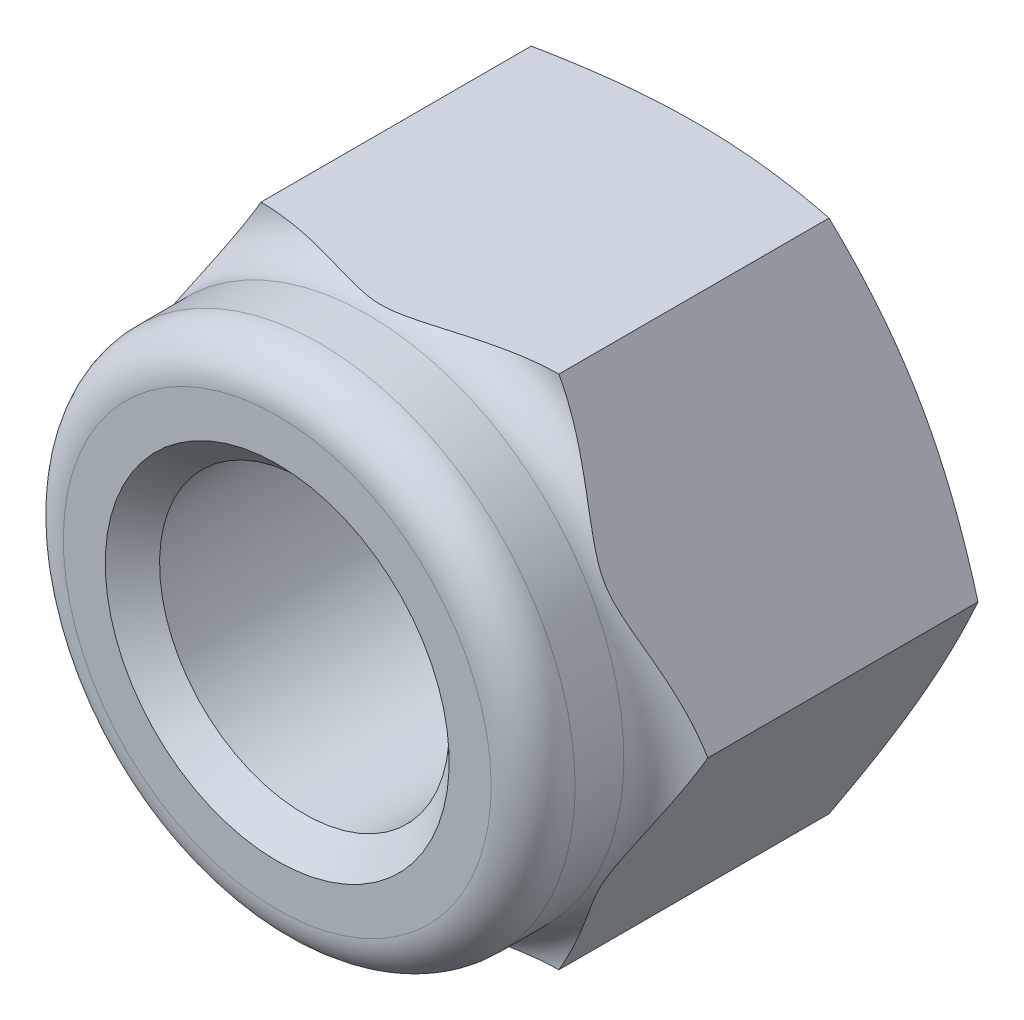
ISO-10303-21;
HEADER;
FILE_DESCRIPTION(('STEP AP214'),'2;1');
FILE_NAME('part.step','',(''),(''),'','','');
FILE_SCHEMA(('AUTOMOTIVE_DESIGN { 1 0 10303 214 1 1 1 1 }'));
ENDSEC;
DATA;
#1=APPLICATION_CONTEXT('core data for automotive mechanical design processes');
#2=APPLICATION_PROTOCOL_DEFINITION('international standard','automotive_design',2000,#1);
#3=PRODUCT_CONTEXT('',#1,'mechanical');
#4=PRODUCT('Part','Part','',(#3));
#5=PRODUCT_RELATED_PRODUCT_CATEGORY('part','',(#4));
#6=PRODUCT_DEFINITION_FORMATION('','',#4);
#7=PRODUCT_DEFINITION_CONTEXT('part definition',#1,'design');
#8=PRODUCT_DEFINITION('design','',#6,#7);
#9=PRODUCT_DEFINITION_SHAPE('','',#8);
#10=(LENGTH_UNIT() NAMED_UNIT(*) SI_UNIT(.MILLI.,.METRE.));
#11=(NAMED_UNIT(*) PLANE_ANGLE_UNIT() SI_UNIT($,.RADIAN.));
#12=(NAMED_UNIT(*) SI_UNIT($,.STERADIAN.) SOLID_ANGLE_UNIT());
#13=UNCERTAINTY_MEASURE_WITH_UNIT(LENGTH_MEASURE(1.E-05),#10,'distance_accuracy_value','');
#14=(GEOMETRIC_REPRESENTATION_CONTEXT(3) GLOBAL_UNCERTAINTY_ASSIGNED_CONTEXT((#13)) GLOBAL_UNIT_ASSIGNED_CONTEXT((#10,
#11,#12)) REPRESENTATION_CONTEXT('',''));
#15=CARTESIAN_POINT('',(0.,0.,0.));
#16=DIRECTION('',(0.,0.,1.));
#17=DIRECTION('',(1.,0.,0.));
#18=AXIS2_PLACEMENT_3D('',#15,#16,#17);
#19=CARTESIAN_POINT('',(0.,0.,0.));
#20=DIRECTION('',(0.,0.,1.));
#21=DIRECTION('',(0.,-1.,0.));
#22=AXIS2_PLACEMENT_3D('',#19,#20,#21);
#23=CONICAL_SURFACE('',#22,8.05896812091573,1.18682389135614);
#24=CARTESIAN_POINT('',(0.,0.,0.));
#25=DIRECTION('',(0.,0.,1.));
#26=DIRECTION('',(1.,0.,0.));
#27=AXIS2_PLACEMENT_3D('',#24,#25,#26);
#28=CIRCLE('',#27,8.05896812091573);
#29=CARTESIAN_POINT('',(8.05896812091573,0.,0.));
#30=VERTEX_POINT('',#29);
#31=EDGE_CURVE('E201',#30,#30,#28,.T.);
#32=ORIENTED_EDGE('',*,*,#31,.T.);
#33=EDGE_LOOP('',(#32));
#34=FACE_BOUND('',#33,.T.);
#35=CARTESIAN_POINT('',(5.19614988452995,8.99999600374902,0.942727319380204));
#36=CARTESIAN_POINT('',(5.37768933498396,8.68556045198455,0.869376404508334));
#37=CARTESIAN_POINT('',(5.5598279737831,8.370087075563,0.801551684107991));
#38=CARTESIAN_POINT('',(5.92530962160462,7.73705429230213,0.679039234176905));
#39=CARTESIAN_POINT('',(6.10865327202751,7.41949377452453,0.624359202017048));
#40=CARTESIAN_POINT('',(6.47628397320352,6.78273872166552,0.530325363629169));
#41=CARTESIAN_POINT('',(6.66057072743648,6.46354470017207,0.490967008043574));
#42=CARTESIAN_POINT('',(7.02982878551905,5.82397098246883,0.429400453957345));
#43=CARTESIAN_POINT('',(7.21479992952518,5.50359156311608,0.407188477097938));
#44=CARTESIAN_POINT('',(7.58192629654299,4.86771004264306,0.381295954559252));
#45=CARTESIAN_POINT('',(7.76407600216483,4.55221749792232,0.377307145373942));
#46=CARTESIAN_POINT('',(8.12826777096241,3.92141885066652,0.387237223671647));
#47=CARTESIAN_POINT('',(8.31030982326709,3.60611276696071,0.401157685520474));
#48=CARTESIAN_POINT('',(8.67373645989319,2.97663936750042,0.446157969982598));
#49=CARTESIAN_POINT('',(8.85512138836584,2.66247145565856,0.477226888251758));
#50=CARTESIAN_POINT('',(9.21702522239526,2.03563562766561,0.555018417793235));
#51=CARTESIAN_POINT('',(9.39754421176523,1.72296756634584,0.601739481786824));
#52=CARTESIAN_POINT('',(9.64562758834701,1.29327455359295,0.67559196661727));
#53=CARTESIAN_POINT('',(9.71364398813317,1.17546669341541,0.696844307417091));
#54=CARTESIAN_POINT('',(9.84951625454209,0.940129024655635,0.741199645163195));
#55=CARTESIAN_POINT('',(9.91737214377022,0.82259917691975,0.764302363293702));
#56=CARTESIAN_POINT('',(10.053161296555,0.587405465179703,0.812333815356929));
#57=CARTESIAN_POINT('',(10.1210940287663,0.469742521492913,0.837268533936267));
#58=CARTESIAN_POINT('',(10.2568106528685,0.234674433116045,0.888788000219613));
#59=CARTESIAN_POINT('',(10.324594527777,0.117269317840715,0.915372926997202));
#60=CARTESIAN_POINT('',(10.39230011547,-1.99999999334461E-07,0.942727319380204));
#61=B_SPLINE_CURVE_WITH_KNOTS('',3,(#35,#36,#37,#38,#39,#40,#41,#42,#43,#44,#45,#46,#47,#48,#49,
#50,#51,#52,#53,#54,#55,#56,#57,#58,#59,#60),.UNSPECIFIED.,.F.,.F.,(4,2,2,2,2,2,2,2,2,2,2,2,4),
(0.,1.1113202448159,2.22328968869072,3.33492871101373,4.44632270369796,5.5388449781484,
6.63146330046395,7.72338764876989,8.81520408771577,9.22824501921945,9.64122383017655,
10.0556174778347,10.4700561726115),.UNSPECIFIED.);
#62=CARTESIAN_POINT('',(5.19615,8.99999580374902,0.942727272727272));
#63=VERTEX_POINT('',#62);
#64=CARTESIAN_POINT('',(10.3923,0.,0.942727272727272));
#65=VERTEX_POINT('',#64);
#66=EDGE_CURVE('E43',#63,#65,#61,.T.);
#67=ORIENTED_EDGE('',*,*,#66,.T.);
#68=CARTESIAN_POINT('',(10.3923001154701,2.E-07,0.942727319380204));
#69=CARTESIAN_POINT('',(10.2107606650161,-0.314435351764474,0.869376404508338));
#70=CARTESIAN_POINT('',(10.0286220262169,-0.629908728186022,0.801551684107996));
#71=CARTESIAN_POINT('',(9.66314037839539,-1.26294151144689,0.679039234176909));
#72=CARTESIAN_POINT('',(9.4797967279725,-1.58050202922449,0.624359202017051));
#73=CARTESIAN_POINT('',(9.11216602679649,-2.21725708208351,0.530325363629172));
#74=CARTESIAN_POINT('',(8.92787927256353,-2.53645110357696,0.490967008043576));
#75=CARTESIAN_POINT('',(8.55862121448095,-3.1760248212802,0.429400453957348));
#76=CARTESIAN_POINT('',(8.37365007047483,-3.49640424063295,0.407188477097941));
#77=CARTESIAN_POINT('',(8.00652370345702,-4.13228576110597,0.381295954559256));
#78=CARTESIAN_POINT('',(7.82437399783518,-4.44777830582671,0.377307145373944));
#79=CARTESIAN_POINT('',(7.46018222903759,-5.07857695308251,0.38723722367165));
#80=CARTESIAN_POINT('',(7.27814017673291,-5.39388303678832,0.401157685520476));
#81=CARTESIAN_POINT('',(6.91471354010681,-6.02335643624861,0.446157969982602));
#82=CARTESIAN_POINT('',(6.73332861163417,-6.33752434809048,0.477226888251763));
#83=CARTESIAN_POINT('',(6.37142477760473,-6.96436017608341,0.555018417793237));
#84=CARTESIAN_POINT('',(6.19090578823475,-7.27702823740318,0.601739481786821));
#85=CARTESIAN_POINT('',(5.94282241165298,-7.70672125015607,0.675591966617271));
#86=CARTESIAN_POINT('',(5.87480601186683,-7.82452911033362,0.696844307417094));
#87=CARTESIAN_POINT('',(5.73893374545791,-8.0598667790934,0.7411996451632));
#88=CARTESIAN_POINT('',(5.67107785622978,-8.17739662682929,0.764302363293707));
#89=CARTESIAN_POINT('',(5.53528870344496,-8.41259033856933,0.812333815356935));
#90=CARTESIAN_POINT('',(5.46735597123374,-8.53025328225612,0.837268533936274));
#91=CARTESIAN_POINT('',(5.33163934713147,-8.76532137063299,0.888788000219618));
#92=CARTESIAN_POINT('',(5.26385547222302,-8.88272648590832,0.915372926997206));
#93=CARTESIAN_POINT('',(5.19614988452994,-8.99999600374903,0.942727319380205));
#94=B_SPLINE_CURVE_WITH_KNOTS('',3,(#68,#69,#70,#71,#72,#73,#74,#75,#76,#77,#78,#79,#80,#81,#82,
#83,#84,#85,#86,#87,#88,#89,#90,#91,#92,#93),.UNSPECIFIED.,.F.,.F.,(4,2,2,2,2,2,2,2,2,2,2,2,4),
(0.,1.1113202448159,2.22328968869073,3.33492871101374,4.44632270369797,5.53884497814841,
6.63146330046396,7.7233876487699,8.81520408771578,9.22824501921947,9.64122383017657,
10.0556174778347,10.4700561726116),.UNSPECIFIED.);
#95=CARTESIAN_POINT('',(5.19615,-8.99999580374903,0.942727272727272));
#96=VERTEX_POINT('',#95);
#97=EDGE_CURVE('E36',#65,#96,#94,.T.);
#98=ORIENTED_EDGE('',*,*,#97,.T.);
#99=CARTESIAN_POINT('',(-13.7253881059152,-8.99999580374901,3.37524346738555));
#100=CARTESIAN_POINT('',(-13.3195391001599,-8.99999580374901,3.2381593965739));
#101=CARTESIAN_POINT('',(-12.9131495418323,-8.99999580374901,3.10264611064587));
#102=CARTESIAN_POINT('',(-12.099009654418,-8.99999580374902,2.8356387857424));
#103=CARTESIAN_POINT('',(-11.6912591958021,-8.99999580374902,2.70414514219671));
#104=CARTESIAN_POINT('',(-10.873207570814,-8.99999580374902,2.4457694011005));
#105=CARTESIAN_POINT('',(-10.462902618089,-8.99999580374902,2.31889924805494));
#106=CARTESIAN_POINT('',(-9.64043787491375,-8.99999580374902,2.07133343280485));
#107=CARTESIAN_POINT('',(-9.22827812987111,-8.99999580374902,1.9506376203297));
#108=CARTESIAN_POINT('',(-8.40710282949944,-8.99999580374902,1.7184845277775));
#109=CARTESIAN_POINT('',(-7.99811546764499,-8.99999580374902,1.60692802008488));
#110=CARTESIAN_POINT('',(-7.17765147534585,-8.99999580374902,1.39325632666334));
#111=CARTESIAN_POINT('',(-6.76617477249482,-8.99999580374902,1.2911414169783));
#112=CARTESIAN_POINT('',(-5.94067510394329,-8.99999580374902,1.09879704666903));
#113=CARTESIAN_POINT('',(-5.52665371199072,-8.99999580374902,1.00856088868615));
#114=CARTESIAN_POINT('',(-4.69566889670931,-8.99999580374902,0.842767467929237));
#115=CARTESIAN_POINT('',(-4.27870568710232,-8.99999580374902,0.767209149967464));
#116=CARTESIAN_POINT('',(-3.52750217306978,-8.99999580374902,0.647571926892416));
#117=CARTESIAN_POINT('',(-3.19378653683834,-8.99999580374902,0.600215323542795));
#118=CARTESIAN_POINT('',(-2.52476833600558,-8.99999580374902,0.518375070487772));
#119=CARTESIAN_POINT('',(-2.18946581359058,-8.99999580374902,0.483891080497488));
#120=CARTESIAN_POINT('',(-1.51790364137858,-8.99999580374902,0.429161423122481));
#121=CARTESIAN_POINT('',(-1.18164474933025,-8.99999580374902,0.408906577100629));
#122=CARTESIAN_POINT('',(-0.508551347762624,-8.99999580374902,0.383484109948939));
#123=CARTESIAN_POINT('',(-0.171716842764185,-8.99999580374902,0.378316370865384));
#124=CARTESIAN_POINT('',(0.503470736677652,-8.99999580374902,0.383318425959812));
#125=CARTESIAN_POINT('',(0.841823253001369,-8.99999580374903,0.393562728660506));
#126=CARTESIAN_POINT('',(1.51773437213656,-8.99999580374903,0.429054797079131));
#127=CARTESIAN_POINT('',(1.85529296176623,-8.99999580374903,0.45430281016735));
#128=CARTESIAN_POINT('',(2.52927670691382,-8.99999580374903,0.518743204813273));
#129=CARTESIAN_POINT('',(2.86570100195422,-8.99999580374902,0.557944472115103));
#130=CARTESIAN_POINT('',(3.53683980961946,-8.99999580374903,0.648814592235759));
#131=CARTESIAN_POINT('',(3.87155432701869,-8.99999580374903,0.70048341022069));
#132=CARTESIAN_POINT('',(4.59509236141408,-8.99999580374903,0.824231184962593));
#133=CARTESIAN_POINT('',(4.98357679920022,-8.99999580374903,0.898279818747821));
#134=CARTESIAN_POINT('',(5.75803045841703,-8.99999580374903,1.05862135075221));
#135=CARTESIAN_POINT('',(6.14399936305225,-8.99999580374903,1.14491576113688));
#136=CARTESIAN_POINT('',(6.91374269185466,-8.99999580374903,1.32752958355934));
#137=CARTESIAN_POINT('',(7.2975159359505,-8.99999580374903,1.4238539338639));
#138=CARTESIAN_POINT('',(8.06291284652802,-8.99999580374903,1.62459154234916));
#139=CARTESIAN_POINT('',(8.44453659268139,-8.99999580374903,1.72900449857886));
#140=CARTESIAN_POINT('',(9.20692169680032,-8.99999580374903,1.94466471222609));
#141=CARTESIAN_POINT('',(9.58767816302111,-8.99999580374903,2.05592918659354));
#142=CARTESIAN_POINT('',(10.3475844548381,-8.99999580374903,2.28380628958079));
#143=CARTESIAN_POINT('',(10.7267342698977,-8.99999580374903,2.40041895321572));
#144=CARTESIAN_POINT('',(11.4835553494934,-8.99999580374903,2.6379757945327));
#145=CARTESIAN_POINT('',(11.8612269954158,-8.99999580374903,2.75891876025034));
#146=CARTESIAN_POINT('',(12.6154024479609,-8.99999580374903,3.00439747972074));
#147=CARTESIAN_POINT('',(12.9919062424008,-8.99999580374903,3.12893327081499));
#148=CARTESIAN_POINT('',(14.1148198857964,-8.99999580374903,3.50525975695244));
#149=CARTESIAN_POINT('',(14.8597706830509,-8.99999580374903,3.7614026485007));
#150=CARTESIAN_POINT('',(16.3468555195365,-8.99999580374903,4.28186809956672));
#151=CARTESIAN_POINT('',(17.0889893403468,-8.99999580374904,4.54619127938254));
#152=CARTESIAN_POINT('',(18.5662148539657,-8.99999580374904,5.07900081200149));
#153=CARTESIAN_POINT('',(19.3013206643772,-8.99999580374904,5.34744808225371));
#154=CARTESIAN_POINT('',(20.4027231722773,-8.99999580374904,5.75337513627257));
#155=CARTESIAN_POINT('',(20.7696249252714,-8.99999580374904,5.88921819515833));
#156=CARTESIAN_POINT('',(21.5030707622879,-8.99999580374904,6.16186256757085));
#157=CARTESIAN_POINT('',(21.869614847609,-8.99999580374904,6.29866387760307));
#158=CARTESIAN_POINT('',(22.2360042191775,-8.99999580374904,6.43587854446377));
#159=B_SPLINE_CURVE_WITH_KNOTS('',3,(#99,#100,#101,#102,#103,#104,#105,#106,#107,#108,#109,#110,
#111,#112,#113,#114,#115,#116,#117,#118,#119,#120,#121,#122,#123,#124,#125,#126,#127,#128,#129,
#130,#131,#132,#133,#134,#135,#136,#137,#138,#139,#140,#141,#142,#143,#144,#145,#146,#147,#148,
#149,#150,#151,#152,#153,#154,#155,#156,#157,#158),.UNSPECIFIED.,.F.,.F.,(4,2,2,2,2,2,2,2,2,2,2,
2,2,2,2,2,2,2,2,2,2,2,2,2,2,2,2,2,2,4),(0.,1.2851370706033,2.5704001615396,3.85877713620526,
5.14712273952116,6.41882016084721,7.69055475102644,8.96156922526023,10.2324922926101,
11.2434537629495,12.2543885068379,13.264670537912,14.2749446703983,15.2901186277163,
16.3053093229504,17.3211476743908,18.3369831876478,19.5231723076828,20.7095080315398,
21.8964306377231,23.0833089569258,24.2733021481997,25.4633031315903,26.6529736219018,
27.8426564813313,30.2058484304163,32.5692200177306,34.9169650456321,36.0906898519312,
37.2644103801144),.UNSPECIFIED.);
#160=CARTESIAN_POINT('',(-5.19615,-8.99999580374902,0.942727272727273));
#161=VERTEX_POINT('',#160);
#162=EDGE_CURVE('E81',#96,#161,#159,.F.);
#163=ORIENTED_EDGE('',*,*,#162,.T.);
#164=CARTESIAN_POINT('',(-5.19614988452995,-8.99999600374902,0.942727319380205));
#165=CARTESIAN_POINT('',(-5.37768933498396,-8.68556045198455,0.869376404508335));
#166=CARTESIAN_POINT('',(-5.5598279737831,-8.370087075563,0.801551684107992));
#167=CARTESIAN_POINT('',(-5.92530962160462,-7.73705429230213,0.679039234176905));
#168=CARTESIAN_POINT('',(-6.10865327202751,-7.41949377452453,0.624359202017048));
#169=CARTESIAN_POINT('',(-6.47628397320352,-6.78273872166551,0.53032536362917));
#170=CARTESIAN_POINT('',(-6.66057072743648,-6.46354470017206,0.490967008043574));
#171=CARTESIAN_POINT('',(-7.02982878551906,-5.82397098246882,0.429400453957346));
#172=CARTESIAN_POINT('',(-7.21479992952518,-5.50359156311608,0.407188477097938));
#173=CARTESIAN_POINT('',(-7.58192629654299,-4.86771004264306,0.381295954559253));
#174=CARTESIAN_POINT('',(-7.76407600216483,-4.55221749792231,0.377307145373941));
#175=CARTESIAN_POINT('',(-8.12826777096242,-3.92141885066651,0.387237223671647));
#176=CARTESIAN_POINT('',(-8.31030982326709,-3.6061127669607,0.401157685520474));
#177=CARTESIAN_POINT('',(-8.6737364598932,-2.97663936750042,0.446157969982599));
#178=CARTESIAN_POINT('',(-8.85512138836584,-2.66247145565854,0.477226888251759));
#179=CARTESIAN_POINT('',(-9.21702522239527,-2.03563562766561,0.555018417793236));
#180=CARTESIAN_POINT('',(-9.39754421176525,-1.72296756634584,0.601739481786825));
#181=CARTESIAN_POINT('',(-9.64562758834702,-1.29327455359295,0.675591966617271));
#182=CARTESIAN_POINT('',(-9.71364398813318,-1.1754666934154,0.696844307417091));
#183=CARTESIAN_POINT('',(-9.84951625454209,-0.940129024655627,0.741199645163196));
#184=CARTESIAN_POINT('',(-9.91737214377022,-0.822599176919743,0.764302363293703));
#185=CARTESIAN_POINT('',(-10.053161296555,-0.587405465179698,0.81233381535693));
#186=CARTESIAN_POINT('',(-10.1210940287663,-0.469742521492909,0.837268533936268));
#187=CARTESIAN_POINT('',(-10.2568106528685,-0.234674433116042,0.888788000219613));
#188=CARTESIAN_POINT('',(-10.324594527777,-0.117269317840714,0.915372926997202));
#189=CARTESIAN_POINT('',(-10.39230011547,1.99999999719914E-07,0.942727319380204));
#190=B_SPLINE_CURVE_WITH_KNOTS('',3,(#164,#165,#166,#167,#168,#169,#170,#171,#172,#173,#174,
#175,#176,#177,#178,#179,#180,#181,#182,#183,#184,#185,#186,#187,#188,#189),.UNSPECIFIED.,.F.,
.F.,(4,2,2,2,2,2,2,2,2,2,2,2,4),(0.,1.1113202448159,2.22328968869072,3.33492871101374,
4.44632270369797,5.53884497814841,6.63146330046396,7.7233876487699,8.81520408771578,
9.22824501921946,9.64122383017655,10.0556174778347,10.4700561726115),.UNSPECIFIED.);
#191=CARTESIAN_POINT('',(-10.3923,0.,0.942727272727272));
#192=VERTEX_POINT('',#191);
#193=EDGE_CURVE('E89',#161,#192,#190,.T.);
#194=ORIENTED_EDGE('',*,*,#193,.T.);
#195=CARTESIAN_POINT('',(-10.3923001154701,-2.E-07,0.942727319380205));
#196=CARTESIAN_POINT('',(-10.2107606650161,0.314435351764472,0.869376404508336));
#197=CARTESIAN_POINT('',(-10.0286220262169,0.629908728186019,0.801551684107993));
#198=CARTESIAN_POINT('',(-9.66314037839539,1.26294151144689,0.679039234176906));
#199=CARTESIAN_POINT('',(-9.4797967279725,1.58050202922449,0.624359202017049));
#200=CARTESIAN_POINT('',(-9.11216602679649,2.2172570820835,0.53032536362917));
#201=CARTESIAN_POINT('',(-8.92787927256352,2.53645110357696,0.490967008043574));
#202=CARTESIAN_POINT('',(-8.55862121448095,3.17602482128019,0.429400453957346));
#203=CARTESIAN_POINT('',(-8.37365007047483,3.49640424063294,0.407188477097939));
#204=CARTESIAN_POINT('',(-8.00652370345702,4.13228576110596,0.381295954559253));
#205=CARTESIAN_POINT('',(-7.82437399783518,4.4477783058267,0.377307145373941));
#206=CARTESIAN_POINT('',(-7.46018222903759,5.0785769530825,0.387237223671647));
#207=CARTESIAN_POINT('',(-7.27814017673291,5.39388303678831,0.401157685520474));
#208=CARTESIAN_POINT('',(-6.91471354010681,6.0233564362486,0.446157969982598));
#209=CARTESIAN_POINT('',(-6.73332861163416,6.33752434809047,0.477226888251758));
#210=CARTESIAN_POINT('',(-6.37142477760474,6.96436017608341,0.555018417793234));
#211=CARTESIAN_POINT('',(-6.19090578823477,7.27702823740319,0.601739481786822));
#212=CARTESIAN_POINT('',(-5.94282241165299,7.70672125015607,0.675591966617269));
#213=CARTESIAN_POINT('',(-5.87480601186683,7.82452911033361,0.69684430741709));
#214=CARTESIAN_POINT('',(-5.73893374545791,8.05986677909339,0.741199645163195));
#215=CARTESIAN_POINT('',(-5.67107785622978,8.17739662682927,0.764302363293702));
#216=CARTESIAN_POINT('',(-5.53528870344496,8.41259033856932,0.812333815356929));
#217=CARTESIAN_POINT('',(-5.46735597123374,8.53025328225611,0.837268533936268));
#218=CARTESIAN_POINT('',(-5.33163934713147,8.76532137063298,0.888788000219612));
#219=CARTESIAN_POINT('',(-5.26385547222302,8.88272648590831,0.915372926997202));
#220=CARTESIAN_POINT('',(-5.19614988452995,8.99999600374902,0.942727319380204));
#221=B_SPLINE_CURVE_WITH_KNOTS('',3,(#195,#196,#197,#198,#199,#200,#201,#202,#203,#204,#205,
#206,#207,#208,#209,#210,#211,#212,#213,#214,#215,#216,#217,#218,#219,#220),.UNSPECIFIED.,.F.,
.F.,(4,2,2,2,2,2,2,2,2,2,2,2,4),(0.,1.1113202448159,2.22328968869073,3.33492871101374,
4.44632270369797,5.53884497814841,6.63146330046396,7.7233876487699,8.81520408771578,
9.22824501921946,9.64122383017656,10.0556174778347,10.4700561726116),.UNSPECIFIED.);
#222=CARTESIAN_POINT('',(-5.19615,8.99999580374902,0.942727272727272));
#223=VERTEX_POINT('',#222);
#224=EDGE_CURVE('E94',#192,#223,#221,.T.);
#225=ORIENTED_EDGE('',*,*,#224,.T.);
#226=CARTESIAN_POINT('',(-13.7253881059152,8.99999580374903,3.37524346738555));
#227=CARTESIAN_POINT('',(-13.3195391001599,8.99999580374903,3.2381593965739));
#228=CARTESIAN_POINT('',(-12.9131495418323,8.99999580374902,3.10264611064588));
#229=CARTESIAN_POINT('',(-12.099009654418,8.99999580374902,2.8356387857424));
#230=CARTESIAN_POINT('',(-11.6912591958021,8.99999580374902,2.70414514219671));
#231=CARTESIAN_POINT('',(-10.873207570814,8.99999580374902,2.4457694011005));
#232=CARTESIAN_POINT('',(-10.462902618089,8.99999580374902,2.31889924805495));
#233=CARTESIAN_POINT('',(-9.64043787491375,8.99999580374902,2.07133343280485));
#234=CARTESIAN_POINT('',(-9.22827812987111,8.99999580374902,1.9506376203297));
#235=CARTESIAN_POINT('',(-8.40710282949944,8.99999580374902,1.7184845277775));
#236=CARTESIAN_POINT('',(-7.99811546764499,8.99999580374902,1.60692802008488));
#237=CARTESIAN_POINT('',(-7.17765147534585,8.99999580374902,1.39325632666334));
#238=CARTESIAN_POINT('',(-6.76617477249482,8.99999580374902,1.2911414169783));
#239=CARTESIAN_POINT('',(-5.94067510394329,8.99999580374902,1.09879704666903));
#240=CARTESIAN_POINT('',(-5.52665371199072,8.99999580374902,1.00856088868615));
#241=CARTESIAN_POINT('',(-4.69566889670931,8.99999580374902,0.842767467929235));
#242=CARTESIAN_POINT('',(-4.27870568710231,8.99999580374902,0.767209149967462));
#243=CARTESIAN_POINT('',(-3.52750217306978,8.99999580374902,0.647571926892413));
#244=CARTESIAN_POINT('',(-3.19378653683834,8.99999580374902,0.600215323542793));
#245=CARTESIAN_POINT('',(-2.52476833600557,8.99999580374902,0.51837507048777));
#246=CARTESIAN_POINT('',(-2.18946581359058,8.99999580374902,0.483891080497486));
#247=CARTESIAN_POINT('',(-1.51790364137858,8.99999580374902,0.429161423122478));
#248=CARTESIAN_POINT('',(-1.18164474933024,8.99999580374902,0.408906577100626));
#249=CARTESIAN_POINT('',(-0.508551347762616,8.99999580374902,0.383484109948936));
#250=CARTESIAN_POINT('',(-0.171716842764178,8.99999580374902,0.378316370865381));
#251=CARTESIAN_POINT('',(0.50347073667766,8.99999580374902,0.383318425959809));
#252=CARTESIAN_POINT('',(0.841823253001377,8.99999580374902,0.393562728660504));
#253=CARTESIAN_POINT('',(1.51773437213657,8.99999580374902,0.429054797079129));
#254=CARTESIAN_POINT('',(1.85529296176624,8.99999580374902,0.454302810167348));
#255=CARTESIAN_POINT('',(2.52927670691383,8.99999580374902,0.51874320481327));
#256=CARTESIAN_POINT('',(2.86570100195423,8.99999580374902,0.557944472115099));
#257=CARTESIAN_POINT('',(3.53683980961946,8.99999580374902,0.648814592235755));
#258=CARTESIAN_POINT('',(3.87155432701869,8.99999580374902,0.700483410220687));
#259=CARTESIAN_POINT('',(4.59509236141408,8.99999580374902,0.824231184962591));
#260=CARTESIAN_POINT('',(4.98357679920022,8.99999580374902,0.898279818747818));
#261=CARTESIAN_POINT('',(5.75803045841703,8.99999580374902,1.05862135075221));
#262=CARTESIAN_POINT('',(6.14399936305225,8.99999580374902,1.14491576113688));
#263=CARTESIAN_POINT('',(6.91374269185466,8.99999580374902,1.32752958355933));
#264=CARTESIAN_POINT('',(7.2975159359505,8.99999580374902,1.42385393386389));
#265=CARTESIAN_POINT('',(8.06291284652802,8.99999580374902,1.62459154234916));
#266=CARTESIAN_POINT('',(8.44453659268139,8.99999580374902,1.72900449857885));
#267=CARTESIAN_POINT('',(9.20692169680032,8.99999580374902,1.94466471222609));
#268=CARTESIAN_POINT('',(9.5876781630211,8.99999580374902,2.05592918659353));
#269=CARTESIAN_POINT('',(10.3475844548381,8.99999580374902,2.28380628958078));
#270=CARTESIAN_POINT('',(10.7267342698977,8.99999580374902,2.40041895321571));
#271=CARTESIAN_POINT('',(11.4835553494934,8.99999580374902,2.6379757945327));
#272=CARTESIAN_POINT('',(11.8612269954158,8.99999580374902,2.75891876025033));
#273=CARTESIAN_POINT('',(12.6154024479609,8.99999580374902,3.00439747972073));
#274=CARTESIAN_POINT('',(12.9919062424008,8.99999580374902,3.12893327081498));
#275=CARTESIAN_POINT('',(14.1148198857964,8.99999580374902,3.50525975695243));
#276=CARTESIAN_POINT('',(14.8597706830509,8.99999580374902,3.76140264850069));
#277=CARTESIAN_POINT('',(16.3468555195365,8.99999580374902,4.28186809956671));
#278=CARTESIAN_POINT('',(17.0889893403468,8.99999580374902,4.54619127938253));
#279=CARTESIAN_POINT('',(18.5662148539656,8.99999580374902,5.07900081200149));
#280=CARTESIAN_POINT('',(19.3013206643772,8.99999580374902,5.34744808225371));
#281=CARTESIAN_POINT('',(20.4027231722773,8.99999580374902,5.75337513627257));
#282=CARTESIAN_POINT('',(20.7696249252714,8.99999580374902,5.88921819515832));
#283=CARTESIAN_POINT('',(21.5030707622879,8.99999580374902,6.16186256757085));
#284=CARTESIAN_POINT('',(21.869614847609,8.99999580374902,6.29866387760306));
#285=CARTESIAN_POINT('',(22.2360042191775,8.99999580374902,6.43587854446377));
#286=B_SPLINE_CURVE_WITH_KNOTS('',3,(#226,#227,#228,#229,#230,#231,#232,#233,#234,#235,#236,
#237,#238,#239,#240,#241,#242,#243,#244,#245,#246,#247,#248,#249,#250,#251,#252,#253,#254,#255,
#256,#257,#258,#259,#260,#261,#262,#263,#264,#265,#266,#267,#268,#269,#270,#271,#272,#273,#274,
#275,#276,#277,#278,#279,#280,#281,#282,#283,#284,#285),.UNSPECIFIED.,.F.,.F.,(4,2,2,2,2,2,2,2,
2,2,2,2,2,2,2,2,2,2,2,2,2,2,2,2,2,2,2,2,2,4),(0.,1.2851370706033,2.5704001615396,
3.85877713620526,5.14712273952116,6.41882016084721,7.69055475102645,8.96156922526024,
10.2324922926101,11.2434537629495,12.2543885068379,13.264670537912,14.2749446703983,
15.2901186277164,16.3053093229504,17.3211476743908,18.3369831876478,19.5231723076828,
20.7095080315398,21.8964306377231,23.0833089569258,24.2733021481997,25.4633031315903,
26.6529736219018,27.8426564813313,30.2058484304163,32.5692200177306,34.9169650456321,
36.0906898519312,37.2644103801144),.UNSPECIFIED.);
#287=EDGE_CURVE('E179',#223,#63,#286,.T.);
#288=ORIENTED_EDGE('',*,*,#287,.T.);
#289=EDGE_LOOP('',(#67,#98,#163,#194,#225,#288));
#290=FACE_BOUND('',#289,.T.);
#291=ADVANCED_FACE('F16',(#34,#290),#23,.T.);
#292=CARTESIAN_POINT('',(10.3923,0.,0.));
#293=DIRECTION('',(0.,0.,1.));
#294=DIRECTION('',(1.,0.,0.));
#295=AXIS2_PLACEMENT_3D('',#292,#293,#294);
#296=PLANE('',#295);
#297=CARTESIAN_POINT('',(0.,0.,0.));
#298=DIRECTION('',(0.,0.,1.));
#299=DIRECTION('',(1.,0.,0.));
#300=AXIS2_PLACEMENT_3D('',#297,#298,#299);
#301=CIRCLE('',#300,6.);
#302=CARTESIAN_POINT('',(6.,0.,0.));
#303=VERTEX_POINT('',#302);
#304=EDGE_CURVE('E204',#303,#303,#301,.F.);
#305=ORIENTED_EDGE('',*,*,#304,.F.);
#306=EDGE_LOOP('',(#305));
#307=FACE_BOUND('',#306,.T.);
#308=ORIENTED_EDGE('',*,*,#31,.F.);
#309=EDGE_LOOP('',(#308));
#310=FACE_BOUND('',#309,.T.);
#311=ADVANCED_FACE('F223',(#307,#310),#296,.F.);
#312=CARTESIAN_POINT('',(0.,0.,15.));
#313=DIRECTION('',(0.,0.,1.));
#314=DIRECTION('',(0.,-1.,0.));
#315=AXIS2_PLACEMENT_3D('',#312,#313,#314);
#316=CONICAL_SURFACE('',#315,6.,0.785398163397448);
#317=CARTESIAN_POINT('',(0.,0.,14.0528125));
#318=DIRECTION('',(0.,0.,-1.));
#319=DIRECTION('',(0.,1.,0.));
#320=AXIS2_PLACEMENT_3D('',#317,#318,#319);
#321=CIRCLE('',#320,5.0528125);
#322=CARTESIAN_POINT('',(0.,5.0528125,14.0528125));
#323=VERTEX_POINT('',#322);
#324=EDGE_CURVE('E243',#323,#323,#321,.T.);
#325=ORIENTED_EDGE('',*,*,#324,.T.);
#326=EDGE_LOOP('',(#325));
#327=FACE_BOUND('',#326,.T.);
#328=CARTESIAN_POINT('',(0.,0.,15.));
#329=DIRECTION('',(0.,0.,-1.));
#330=DIRECTION('',(0.,1.,0.));
#331=AXIS2_PLACEMENT_3D('',#328,#329,#330);
#332=CIRCLE('',#331,6.);
#333=CARTESIAN_POINT('',(0.,6.,15.));
#334=VERTEX_POINT('',#333);
#335=EDGE_CURVE('E246',#334,#334,#332,.T.);
#336=ORIENTED_EDGE('',*,*,#335,.F.);
#337=EDGE_LOOP('',(#336));
#338=FACE_BOUND('',#337,.T.);
#339=ADVANCED_FACE('F228',(#327,#338),#316,.F.);
#340=CARTESIAN_POINT('',(0.,0.,0.));
#341=DIRECTION('',(0.,0.,-1.));
#342=DIRECTION('',(0.,1.,0.));
#343=AXIS2_PLACEMENT_3D('',#340,#341,#342);
#344=CYLINDRICAL_SURFACE('',#343,5.0528125);
#345=CARTESIAN_POINT('',(0.,0.,0.9471875));
#346=DIRECTION('',(0.,0.,-1.));
#347=DIRECTION('',(0.,1.,0.));
#348=AXIS2_PLACEMENT_3D('',#345,#346,#347);
#349=CIRCLE('',#348,5.0528125);
#350=CARTESIAN_POINT('',(0.,5.0528125,0.9471875));
#351=VERTEX_POINT('',#350);
#352=EDGE_CURVE('E241',#351,#351,#349,.T.);
#353=ORIENTED_EDGE('',*,*,#352,.T.);
#354=EDGE_LOOP('',(#353));
#355=FACE_BOUND('',#354,.T.);
#356=ORIENTED_EDGE('',*,*,#324,.F.);
#357=EDGE_LOOP('',(#356));
#358=FACE_BOUND('',#357,.T.);
#359=ADVANCED_FACE('F219',(#355,#358),#344,.F.);
#360=CARTESIAN_POINT('',(0.,0.,0.9471875));
#361=DIRECTION('',(0.,0.,-1.));
#362=DIRECTION('',(0.,1.,0.));
#363=AXIS2_PLACEMENT_3D('',#360,#361,#362);
#364=CONICAL_SURFACE('',#363,5.0528125,0.785398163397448);
#365=ORIENTED_EDGE('',*,*,#304,.T.);
#366=EDGE_LOOP('',(#365));
#367=FACE_BOUND('',#366,.T.);
#368=ORIENTED_EDGE('',*,*,#352,.F.);
#369=EDGE_LOOP('',(#368));
#370=FACE_BOUND('',#369,.T.);
#371=ADVANCED_FACE('F213',(#367,#370),#364,.F.);
#372=CARTESIAN_POINT('',(10.3923,0.,15.));
#373=DIRECTION('',(0.,0.,1.));
#374=DIRECTION('',(1.,0.,0.));
#375=AXIS2_PLACEMENT_3D('',#372,#373,#374);
#376=PLANE('',#375);
#377=ORIENTED_EDGE('',*,*,#335,.T.);
#378=EDGE_LOOP('',(#377));
#379=FACE_BOUND('',#378,.T.);
#380=CARTESIAN_POINT('',(0.,0.,15.));
#381=DIRECTION('',(0.,0.,-1.));
#382=DIRECTION('',(0.,1.,0.));
#383=AXIS2_PLACEMENT_3D('',#380,#381,#382);
#384=CIRCLE('',#383,7.4641);
#385=CARTESIAN_POINT('',(0.,7.4641,15.));
#386=VERTEX_POINT('',#385);
#387=EDGE_CURVE('E29',#386,#386,#384,.T.);
#388=ORIENTED_EDGE('',*,*,#387,.F.);
#389=EDGE_LOOP('',(#388));
#390=FACE_BOUND('',#389,.T.);
#391=ADVANCED_FACE('F116',(#379,#390),#376,.T.);
#392=CARTESIAN_POINT('',(0.,0.,11.8341));
#393=DIRECTION('',(0.,0.,-1.));
#394=DIRECTION('',(0.,1.,0.));
#395=AXIS2_PLACEMENT_3D('',#392,#393,#394);
#396=TOROIDAL_SURFACE('',#395,10.3923,1.4641);
#397=CARTESIAN_POINT('',(0.,0.,11.8341));
#398=DIRECTION('',(0.,0.,-1.));
#399=DIRECTION('',(0.,1.,0.));
#400=AXIS2_PLACEMENT_3D('',#397,#398,#399);
#401=CIRCLE('',#400,8.9282);
#402=CARTESIAN_POINT('',(0.,8.9282,11.8341));
#403=VERTEX_POINT('',#402);
#404=EDGE_CURVE('E96',#403,#403,#401,.T.);
#405=ORIENTED_EDGE('',*,*,#404,.T.);
#406=EDGE_LOOP('',(#405));
#407=FACE_BOUND('',#406,.T.);
#408=CARTESIAN_POINT('',(10.3923001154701,2.E-07,10.37));
#409=CARTESIAN_POINT('',(10.3371368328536,-0.0955454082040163,10.370020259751));
#410=CARTESIAN_POINT('',(10.2819941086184,-0.191055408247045,10.3731162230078));
#411=CARTESIAN_POINT('',(10.1718854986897,-0.381769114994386,10.3847196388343));
#412=CARTESIAN_POINT('',(10.1169195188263,-0.476972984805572,10.3932234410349));
#413=CARTESIAN_POINT('',(10.007393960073,-0.666676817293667,10.4148713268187));
#414=CARTESIAN_POINT('',(9.95283365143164,-0.761178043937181,10.4280010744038));
#415=CARTESIAN_POINT('',(9.84398662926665,-0.949706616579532,10.4582965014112));
#416=CARTESIAN_POINT('',(9.78969997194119,-1.04373386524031,10.475462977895));
#417=CARTESIAN_POINT('',(9.62693925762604,-1.32564369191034,10.5322939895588));
#418=CARTESIAN_POINT('',(9.51892327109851,-1.51273286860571,10.5772117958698));
#419=CARTESIAN_POINT('',(9.30406306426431,-1.88488166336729,10.6770126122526));
#420=CARTESIAN_POINT('',(9.19721914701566,-2.06994075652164,10.7318981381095));
#421=CARTESIAN_POINT('',(9.00450425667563,-2.40373273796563,10.8367553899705));
#422=CARTESIAN_POINT('',(8.91848956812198,-2.55271454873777,10.8856923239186));
#423=CARTESIAN_POINT('',(8.74666031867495,-2.85033153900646,10.9850934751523));
#424=CARTESIAN_POINT('',(8.66084581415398,-2.99896662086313,11.0355580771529));
#425=CARTESIAN_POINT('',(8.53271937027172,-3.22088813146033,11.1090751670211));
#426=CARTESIAN_POINT('',(8.49053227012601,-3.29395833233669,11.1329870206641));
#427=CARTESIAN_POINT('',(8.40598630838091,-3.44039623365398,11.1795551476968));
#428=CARTESIAN_POINT('',(8.36362745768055,-3.51376391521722,11.2022114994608));
#429=CARTESIAN_POINT('',(8.2786368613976,-3.66097194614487,11.2453145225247));
#430=CARTESIAN_POINT('',(8.23600520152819,-3.73481214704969,11.2657618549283));
#431=CARTESIAN_POINT('',(8.15036092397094,-3.88315238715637,11.3031072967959));
#432=CARTESIAN_POINT('',(8.10734841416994,-3.95765223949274,11.32000637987));
#433=CARTESIAN_POINT('',(8.00841568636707,-4.1290087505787,11.3526012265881));
#434=CARTESIAN_POINT('',(7.95233981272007,-4.22613501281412,11.366554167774));
#435=CARTESIAN_POINT('',(7.83983966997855,-4.42099097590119,11.3818792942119));
#436=CARTESIAN_POINT('',(7.78341642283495,-4.51871890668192,11.3832787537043));
#437=CARTESIAN_POINT('',(7.66998412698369,-4.71518940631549,11.3730049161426));
#438=CARTESIAN_POINT('',(7.61298027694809,-4.81392297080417,11.3611207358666));
#439=CARTESIAN_POINT('',(7.52799581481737,-4.9611203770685,11.3358687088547));
#440=CARTESIAN_POINT('',(7.49970955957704,-5.01011360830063,11.3261922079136));
#441=CARTESIAN_POINT('',(7.44332128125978,-5.10778097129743,11.3048887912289));
#442=CARTESIAN_POINT('',(7.41521924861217,-5.15645511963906,11.2932619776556));
#443=CARTESIAN_POINT('',(7.34007266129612,-5.28661282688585,11.2600943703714));
#444=CARTESIAN_POINT('',(7.29317984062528,-5.36783357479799,11.2372000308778));
#445=CARTESIAN_POINT('',(7.19970701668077,-5.52973325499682,11.1889662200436));
#446=CARTESIAN_POINT('',(7.15312708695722,-5.610412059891,11.1636261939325));
#447=CARTESIAN_POINT('',(7.06011863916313,-5.77150741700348,11.1116695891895));
#448=CARTESIAN_POINT('',(7.0136902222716,-5.85192379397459,11.0850522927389));
#449=CARTESIAN_POINT('',(6.92089744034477,-6.01264560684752,11.0313729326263));
#450=CARTESIAN_POINT('',(6.87453307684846,-6.09295104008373,11.0043108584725));
#451=CARTESIAN_POINT('',(6.73556638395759,-6.33364841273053,10.9234832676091));
#452=CARTESIAN_POINT('',(6.64292477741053,-6.49410838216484,10.8699786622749));
#453=CARTESIAN_POINT('',(6.4570763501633,-6.81600730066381,10.7670942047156));
#454=CARTESIAN_POINT('',(6.36386963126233,-6.97744607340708,10.7177136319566));
#455=CARTESIAN_POINT('',(6.18281123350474,-7.29104841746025,10.6287568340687));
#456=CARTESIAN_POINT('',(6.09501363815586,-7.44311831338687,10.5887479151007));
#457=CARTESIAN_POINT('',(5.91862986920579,-7.74862396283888,10.5167586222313));
#458=CARTESIAN_POINT('',(5.83004409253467,-7.90205902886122,10.4847744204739));
#459=CARTESIAN_POINT('',(5.65097271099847,-8.21221975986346,10.4307814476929));
#460=CARTESIAN_POINT('',(5.56047711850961,-8.36896272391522,10.4088993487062));
#461=CARTESIAN_POINT('',(5.42422248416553,-8.60496267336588,10.3861116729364));
#462=CARTESIAN_POINT('',(5.37867123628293,-8.68385974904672,10.3801874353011));
#463=CARTESIAN_POINT('',(5.28746753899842,-8.84182918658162,10.372135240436));
#464=CARTESIAN_POINT('',(5.2418150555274,-8.92090160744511,10.3700088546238));
#465=CARTESIAN_POINT('',(5.19614988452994,-8.99999600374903,10.37));
#466=B_SPLINE_CURVE_WITH_KNOTS('',3,(#408,#409,#410,#411,#412,#413,#414,#415,#416,#417,#418,
#419,#420,#421,#422,#423,#424,#425,#426,#427,#428,#429,#430,#431,#432,#433,#434,#435,#436,#437,
#438,#439,#440,#441,#442,#443,#444,#445,#446,#447,#448,#449,#450,#451,#452,#453,#454,#455,#456,
#457,#458,#459,#460,#461,#462,#463,#464,#465),.UNSPECIFIED.,.F.,.F.,(4,2,2,2,2,2,2,2,2,2,2,2,2,
2,2,2,2,2,2,2,2,2,2,2,2,2,2,2,4),(0.,0.330878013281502,0.661532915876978,0.991171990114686,
1.32087620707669,1.98244573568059,2.64418247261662,3.18072840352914,3.71741059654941,
3.98049712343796,4.24356720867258,4.50655834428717,4.7694772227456,5.10798656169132,
5.44576026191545,5.78897338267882,5.96113357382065,6.13328474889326,6.42283951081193,
6.71246010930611,7.00224542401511,7.29203758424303,7.87058550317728,8.44903212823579,
8.98917612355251,9.52906197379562,10.0755450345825,10.349358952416,10.6232861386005),.UNSPECIFIED.);
#467=CARTESIAN_POINT('',(10.3923,0.,10.37));
#468=VERTEX_POINT('',#467);
#469=CARTESIAN_POINT('',(5.19615,-8.99999580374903,10.37));
#470=VERTEX_POINT('',#469);
#471=EDGE_CURVE('E164',#468,#470,#466,.T.);
#472=ORIENTED_EDGE('',*,*,#471,.F.);
#473=CARTESIAN_POINT('',(5.19614988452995,8.99999600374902,10.37));
#474=CARTESIAN_POINT('',(5.25131316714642,8.904450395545,10.370020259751));
#475=CARTESIAN_POINT('',(5.30645589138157,8.80894039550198,10.3731162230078));
#476=CARTESIAN_POINT('',(5.41656450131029,8.61822668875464,10.3847196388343));
#477=CARTESIAN_POINT('',(5.47153048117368,8.52302281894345,10.3932234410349));
#478=CARTESIAN_POINT('',(5.58105603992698,8.33331898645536,10.4148713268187));
#479=CARTESIAN_POINT('',(5.63561634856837,8.23881775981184,10.4280010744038));
#480=CARTESIAN_POINT('',(5.74446337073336,8.05028918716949,10.4582965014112));
#481=CARTESIAN_POINT('',(5.79875002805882,7.95626193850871,10.475462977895));
#482=CARTESIAN_POINT('',(5.96151074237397,7.67435211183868,10.5322939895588));
#483=CARTESIAN_POINT('',(6.0695267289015,7.48726293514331,10.5772117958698));
#484=CARTESIAN_POINT('',(6.2843869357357,7.11511414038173,10.6770126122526));
#485=CARTESIAN_POINT('',(6.39123085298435,6.93005504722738,10.7318981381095));
#486=CARTESIAN_POINT('',(6.58394574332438,6.59626306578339,10.8367553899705));
#487=CARTESIAN_POINT('',(6.66996043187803,6.44728125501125,10.8856923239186));
#488=CARTESIAN_POINT('',(6.84178968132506,6.14966426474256,10.9850934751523));
#489=CARTESIAN_POINT('',(6.92760418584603,6.00102918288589,11.0355580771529));
#490=CARTESIAN_POINT('',(7.0557306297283,5.77910767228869,11.1090751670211));
#491=CARTESIAN_POINT('',(7.097917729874,5.70603747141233,11.1329870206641));
#492=CARTESIAN_POINT('',(7.1824636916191,5.55959957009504,11.1795551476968));
#493=CARTESIAN_POINT('',(7.22482254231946,5.48623188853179,11.2022114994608));
#494=CARTESIAN_POINT('',(7.30981313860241,5.33902385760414,11.2453145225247));
#495=CARTESIAN_POINT('',(7.35244479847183,5.26518365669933,11.2657618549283));
#496=CARTESIAN_POINT('',(7.43808907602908,5.11684341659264,11.3031072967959));
#497=CARTESIAN_POINT('',(7.48110158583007,5.04234356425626,11.32000637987));
#498=CARTESIAN_POINT('',(7.58003431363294,4.8709870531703,11.3526012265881));
#499=CARTESIAN_POINT('',(7.63611018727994,4.77386079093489,11.366554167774));
#500=CARTESIAN_POINT('',(7.74861033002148,4.57900482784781,11.3818792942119));
#501=CARTESIAN_POINT('',(7.80503357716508,4.48127689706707,11.3832787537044));
#502=CARTESIAN_POINT('',(7.91846587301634,4.2848063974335,11.3730049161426));
#503=CARTESIAN_POINT('',(7.97546972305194,4.18607283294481,11.3611207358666));
#504=CARTESIAN_POINT('',(8.06045418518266,4.03887542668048,11.3358687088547));
#505=CARTESIAN_POINT('',(8.088740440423,3.98988219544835,11.3261922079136));
#506=CARTESIAN_POINT('',(8.14512871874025,3.89221483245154,11.3048887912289));
#507=CARTESIAN_POINT('',(8.17323075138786,3.84354068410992,11.2932619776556));
#508=CARTESIAN_POINT('',(8.24837733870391,3.71338297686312,11.2600943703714));
#509=CARTESIAN_POINT('',(8.29527015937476,3.63216222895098,11.2372000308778));
#510=CARTESIAN_POINT('',(8.38874298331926,3.47026254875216,11.1889662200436));
#511=CARTESIAN_POINT('',(8.43532291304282,3.38958374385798,11.1636261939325));
#512=CARTESIAN_POINT('',(8.52833136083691,3.2284883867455,11.1116695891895));
#513=CARTESIAN_POINT('',(8.57475977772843,3.14807200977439,11.0850522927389));
#514=CARTESIAN_POINT('',(8.66755255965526,2.98735019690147,11.0313729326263));
#515=CARTESIAN_POINT('',(8.71391692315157,2.90704476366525,11.0043108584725));
#516=CARTESIAN_POINT('',(8.85288361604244,2.66634739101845,10.9234832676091));
#517=CARTESIAN_POINT('',(8.9455252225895,2.50588742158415,10.8699786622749));
#518=CARTESIAN_POINT('',(9.13137364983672,2.18398850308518,10.7670942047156));
#519=CARTESIAN_POINT('',(9.22458036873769,2.02254973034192,10.7177136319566));
#520=CARTESIAN_POINT('',(9.40563876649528,1.70894738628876,10.6287568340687));
#521=CARTESIAN_POINT('',(9.49343636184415,1.55687749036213,10.5887479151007));
#522=CARTESIAN_POINT('',(9.66982013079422,1.25137184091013,10.5167586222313));
#523=CARTESIAN_POINT('',(9.75840590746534,1.0979367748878,10.4847744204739));
#524=CARTESIAN_POINT('',(9.93747728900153,0.787776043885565,10.4307814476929));
#525=CARTESIAN_POINT('',(10.0279728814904,0.631033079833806,10.4088993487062));
#526=CARTESIAN_POINT('',(10.1642275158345,0.395033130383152,10.3861116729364));
#527=CARTESIAN_POINT('',(10.2097787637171,0.316136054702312,10.3801874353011));
#528=CARTESIAN_POINT('',(10.3009824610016,0.158166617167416,10.372135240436));
#529=CARTESIAN_POINT('',(10.3466349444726,0.0790941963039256,10.3700088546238));
#530=CARTESIAN_POINT('',(10.39230011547,-1.9999999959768E-07,10.37));
#531=B_SPLINE_CURVE_WITH_KNOTS('',3,(#473,#474,#475,#476,#477,#478,#479,#480,#481,#482,#483,
#484,#485,#486,#487,#488,#489,#490,#491,#492,#493,#494,#495,#496,#497,#498,#499,#500,#501,#502,
#503,#504,#505,#506,#507,#508,#509,#510,#511,#512,#513,#514,#515,#516,#517,#518,#519,#520,#521,
#522,#523,#524,#525,#526,#527,#528,#529,#530),.UNSPECIFIED.,.F.,.F.,(4,2,2,2,2,2,2,2,2,2,2,2,2,
2,2,2,2,2,2,2,2,2,2,2,2,2,2,2,4),(0.,0.330878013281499,0.661532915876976,0.991171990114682,
1.32087620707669,1.98244573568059,2.64418247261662,3.18072840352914,3.71741059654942,
3.98049712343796,4.24356720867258,4.50655834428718,4.76947722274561,5.10798656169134,
5.44576026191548,5.78897338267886,5.96113357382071,6.13328474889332,6.42283951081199,
6.71246010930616,7.00224542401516,7.29203758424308,7.87058550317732,8.44903212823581,
8.98917612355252,9.52906197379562,10.0755450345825,10.349358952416,10.6232861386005),.UNSPECIFIED.);
#532=CARTESIAN_POINT('',(5.19615,8.99999580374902,10.37));
#533=VERTEX_POINT('',#532);
#534=EDGE_CURVE('E159',#533,#468,#531,.T.);
#535=ORIENTED_EDGE('',*,*,#534,.F.);
#536=CARTESIAN_POINT('',(0.,8.99999580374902,11.3812447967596));
#537=CARTESIAN_POINT('',(0.0646063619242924,8.99999580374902,11.3812559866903));
#538=CARTESIAN_POINT('',(0.129204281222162,8.99999580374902,11.3790888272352));
#539=CARTESIAN_POINT('',(0.258141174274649,8.99999580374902,11.3706875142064));
#540=CARTESIAN_POINT('',(0.32248009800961,8.99999580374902,11.3644526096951));
#541=CARTESIAN_POINT('',(0.515307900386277,8.99999580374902,11.3404800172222));
#542=CARTESIAN_POINT('',(0.643125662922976,8.99999580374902,11.317481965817));
#543=CARTESIAN_POINT('',(0.899266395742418,8.99999580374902,11.2629154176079));
#544=CARTESIAN_POINT('',(1.02755376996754,8.99999580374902,11.231194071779));
#545=CARTESIAN_POINT('',(1.28287911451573,8.99999580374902,11.1638457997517));
#546=CARTESIAN_POINT('',(1.40991861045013,8.99999580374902,11.1282245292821));
#547=CARTESIAN_POINT('',(1.67420693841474,8.99999580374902,11.0525799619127));
#548=CARTESIAN_POINT('',(1.81142085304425,8.99999580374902,11.0124376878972));
#549=CARTESIAN_POINT('',(2.08598206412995,8.99999580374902,10.9326015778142));
#550=CARTESIAN_POINT('',(2.22332936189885,8.99999580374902,10.8929077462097));
#551=CARTESIAN_POINT('',(2.49867510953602,8.99999580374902,10.8153508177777));
#552=CARTESIAN_POINT('',(2.63667400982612,8.99999580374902,10.7774892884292));
#553=CARTESIAN_POINT('',(2.91346388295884,8.99999580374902,10.7047951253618));
#554=CARTESIAN_POINT('',(3.05225488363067,8.99999580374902,10.669962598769));
#555=CARTESIAN_POINT('',(3.46776563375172,8.99999580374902,10.572125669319));
#556=CARTESIAN_POINT('',(3.74599511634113,8.99999580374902,10.5150752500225));
#557=CARTESIAN_POINT('',(4.16611347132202,8.99999580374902,10.448059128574));
#558=CARTESIAN_POINT('',(4.30652104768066,8.99999580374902,10.4288203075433));
#559=CARTESIAN_POINT('',(4.58821922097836,8.99999580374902,10.3977744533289));
#560=CARTESIAN_POINT('',(4.72951003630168,8.99999580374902,10.3859693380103));
#561=CARTESIAN_POINT('',(5.01595660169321,8.99999580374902,10.371103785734));
#562=CARTESIAN_POINT('',(5.16112432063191,8.99999580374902,10.3682581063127));
#563=CARTESIAN_POINT('',(5.45119845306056,8.99999580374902,10.3738419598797));
#564=CARTESIAN_POINT('',(5.5961049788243,8.99999580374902,10.3822635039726));
#565=CARTESIAN_POINT('',(5.88406608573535,8.99999580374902,10.4127097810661));
#566=CARTESIAN_POINT('',(6.0271252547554,8.99999580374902,10.4346886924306));
#567=CARTESIAN_POINT('',(6.30959083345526,8.99999580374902,10.4951880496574));
#568=CARTESIAN_POINT('',(6.4490042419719,8.99999580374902,10.5336738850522));
#569=CARTESIAN_POINT('',(6.6969835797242,8.99999580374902,10.622501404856));
#570=CARTESIAN_POINT('',(6.80668989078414,8.99999580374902,10.6696061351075));
#571=CARTESIAN_POINT('',(7.01747219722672,8.99999580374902,10.7802585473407));
#572=CARTESIAN_POINT('',(7.11857215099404,8.99999580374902,10.8437584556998));
#573=CARTESIAN_POINT('',(7.27136217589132,8.99999580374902,10.9626046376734));
#574=CARTESIAN_POINT('',(7.32747557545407,8.99999580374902,11.0122475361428));
#575=CARTESIAN_POINT('',(7.4316566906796,8.99999580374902,11.1194270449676));
#576=CARTESIAN_POINT('',(7.47973298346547,8.99999580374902,11.1769551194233));
#577=CARTESIAN_POINT('',(7.55729602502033,8.99999580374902,11.2886122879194));
#578=CARTESIAN_POINT('',(7.58857114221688,8.99999580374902,11.3414903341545));
#579=CARTESIAN_POINT('',(7.64198974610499,8.99999580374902,11.4517059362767));
#580=CARTESIAN_POINT('',(7.66413940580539,8.99999580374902,11.5090404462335));
#581=CARTESIAN_POINT('',(7.69780079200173,8.99999580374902,11.6272542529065));
#582=CARTESIAN_POINT('',(7.70923429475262,8.99999580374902,11.6881562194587));
#583=CARTESIAN_POINT('',(7.72014243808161,8.99999580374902,11.8110214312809));
#584=CARTESIAN_POINT('',(7.71962281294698,8.99999580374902,11.8729841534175));
#585=CARTESIAN_POINT('',(7.7074706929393,8.99999580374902,11.9883589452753));
#586=CARTESIAN_POINT('',(7.69715798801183,8.99999580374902,12.0419165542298));
#587=CARTESIAN_POINT('',(7.66802954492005,8.99999580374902,12.146646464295));
#588=CARTESIAN_POINT('',(7.64921266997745,8.99999580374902,12.1978184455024));
#589=CARTESIAN_POINT('',(7.6032588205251,8.99999580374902,12.2988167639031));
#590=CARTESIAN_POINT('',(7.57580917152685,8.99999580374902,12.3484992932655));
#591=CARTESIAN_POINT('',(7.51431319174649,8.99999580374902,12.4435628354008));
#592=CARTESIAN_POINT('',(7.48026349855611,8.99999580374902,12.4889416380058));
#593=CARTESIAN_POINT('',(7.38499043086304,8.99999580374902,12.6009047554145));
#594=CARTESIAN_POINT('',(7.31966699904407,8.99999580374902,12.6640071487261));
#595=CARTESIAN_POINT('',(7.17987513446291,8.99999580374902,12.7791081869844));
#596=CARTESIAN_POINT('',(7.10538295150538,8.99999580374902,12.8310769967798));
#597=CARTESIAN_POINT('',(6.90784021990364,8.99999580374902,12.950648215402));
#598=CARTESIAN_POINT('',(6.78055295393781,8.99999580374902,13.0112076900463));
#599=CARTESIAN_POINT('',(6.51839296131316,8.99999580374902,13.1124453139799));
#600=CARTESIAN_POINT('',(6.38350382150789,8.99999580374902,13.1530784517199));
#601=CARTESIAN_POINT('',(6.12699661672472,8.99999580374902,13.2140109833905));
#602=CARTESIAN_POINT('',(6.00581341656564,8.99999580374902,13.2362102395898));
#603=CARTESIAN_POINT('',(5.76193713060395,8.99999580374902,13.2701033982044));
#604=CARTESIAN_POINT('',(5.6392428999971,8.99999580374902,13.2817887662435));
#605=CARTESIAN_POINT('',(5.39337967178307,8.99999580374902,13.2962453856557));
#606=CARTESIAN_POINT('',(5.27021072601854,8.99999580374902,13.2990175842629));
#607=CARTESIAN_POINT('',(5.02400646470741,8.99999580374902,13.2969746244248));
#608=CARTESIAN_POINT('',(4.90097111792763,8.99999580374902,13.2921620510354));
#609=CARTESIAN_POINT('',(4.57385813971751,8.99999580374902,13.2707407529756));
#610=CARTESIAN_POINT('',(4.37015553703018,8.99999580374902,13.2484250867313));
#611=CARTESIAN_POINT('',(3.96464862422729,8.99999580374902,13.1900813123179));
#612=CARTESIAN_POINT('',(3.76284624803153,8.99999580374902,13.1540405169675));
#613=CARTESIAN_POINT('',(3.35929395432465,8.99999580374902,13.0712298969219));
#614=CARTESIAN_POINT('',(3.15756678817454,8.99999580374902,13.0243515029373));
#615=CARTESIAN_POINT('',(2.7562415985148,8.99999580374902,12.923328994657));
#616=CARTESIAN_POINT('',(2.55664131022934,8.99999580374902,12.8691936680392));
#617=CARTESIAN_POINT('',(2.24879817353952,8.99999580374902,12.7824564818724));
#618=CARTESIAN_POINT('',(2.14016206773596,8.99999580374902,12.7512188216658));
#619=CARTESIAN_POINT('',(1.92303191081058,8.99999580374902,12.6882788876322));
#620=CARTESIAN_POINT('',(1.8145378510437,8.99999580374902,12.6565766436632));
#621=CARTESIAN_POINT('',(1.59702639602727,8.99999580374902,12.593477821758));
#622=CARTESIAN_POINT('',(1.48800854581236,8.99999580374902,12.5620828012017));
#623=CARTESIAN_POINT('',(1.26949697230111,8.99999580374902,12.5010043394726));
#624=CARTESIAN_POINT('',(1.16000329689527,8.99999580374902,12.4713207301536));
#625=CARTESIAN_POINT('',(0.942677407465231,8.99999580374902,12.4162990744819));
#626=CARTESIAN_POINT('',(0.834867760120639,8.99999580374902,12.390874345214));
#627=CARTESIAN_POINT('',(0.617938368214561,8.99999580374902,12.346378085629));
#628=CARTESIAN_POINT('',(0.508819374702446,8.99999580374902,12.3273030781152));
#629=CARTESIAN_POINT('',(0.290060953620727,8.99999580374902,12.2993747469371));
#630=CARTESIAN_POINT('',(0.180432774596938,8.99999580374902,12.2904404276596));
#631=CARTESIAN_POINT('',(-0.0391025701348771,8.99999580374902,12.2851740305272));
#632=CARTESIAN_POINT('',(-0.14900956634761,8.99999580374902,12.2888355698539));
#633=CARTESIAN_POINT('',(-0.367806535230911,8.99999580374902,12.3075713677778));
#634=CARTESIAN_POINT('',(-0.476695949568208,8.99999580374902,12.3226515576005));
#635=CARTESIAN_POINT('',(-0.693150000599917,8.99999580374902,12.3606149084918));
#636=CARTESIAN_POINT('',(-0.800712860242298,8.99999580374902,12.3835075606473));
#637=CARTESIAN_POINT('',(-1.01577765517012,8.99999580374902,12.4340903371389));
#638=CARTESIAN_POINT('',(-1.12326867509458,8.99999580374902,12.4618252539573));
#639=CARTESIAN_POINT('',(-1.33753383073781,8.99999580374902,12.5196675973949));
#640=CARTESIAN_POINT('',(-1.44430832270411,8.99999580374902,12.5497737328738));
#641=CARTESIAN_POINT('',(-1.66091433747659,8.99999580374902,12.6118678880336));
#642=CARTESIAN_POINT('',(-1.77073733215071,8.99999580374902,12.6438853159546));
#643=CARTESIAN_POINT('',(-1.99040881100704,8.99999580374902,12.7078320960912));
#644=CARTESIAN_POINT('',(-2.1002572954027,8.99999580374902,12.7397614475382));
#645=CARTESIAN_POINT('',(-2.42931980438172,8.99999580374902,12.8339497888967));
#646=CARTESIAN_POINT('',(-2.64892679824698,8.99999580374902,12.8948753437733));
#647=CARTESIAN_POINT('',(-3.08753524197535,8.99999580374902,13.0076753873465));
#648=CARTESIAN_POINT('',(-3.30650884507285,8.99999580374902,13.0596551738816));
#649=CARTESIAN_POINT('',(-3.74739723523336,8.99999580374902,13.151504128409));
#650=CARTESIAN_POINT('',(-3.96931605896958,8.99999580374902,13.1913543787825));
#651=CARTESIAN_POINT('',(-4.41357272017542,8.99999580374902,13.2540040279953));
#652=CARTESIAN_POINT('',(-4.63588647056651,8.99999580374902,13.2769620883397));
#653=CARTESIAN_POINT('',(-4.97008331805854,8.99999580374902,13.2949034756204));
#654=CARTESIAN_POINT('',(-5.08153175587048,8.99999580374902,13.2981378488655));
#655=CARTESIAN_POINT('',(-5.30441904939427,8.99999580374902,13.2982604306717));
#656=CARTESIAN_POINT('',(-5.41585789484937,8.99999580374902,13.2951508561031));
#657=CARTESIAN_POINT('',(-5.62176476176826,8.99999580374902,13.2826016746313));
#658=CARTESIAN_POINT('',(-5.71629305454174,8.99999580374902,13.274171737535));
#659=CARTESIAN_POINT('',(-5.90465605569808,8.99999580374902,13.2512609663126));
#660=CARTESIAN_POINT('',(-5.99849059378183,8.99999580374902,13.2367786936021));
#661=CARTESIAN_POINT('',(-6.18461694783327,8.99999580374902,13.2009566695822));
#662=CARTESIAN_POINT('',(-6.27691211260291,8.99999580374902,13.1796346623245));
#663=CARTESIAN_POINT('',(-6.45929419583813,8.99999580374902,13.1291430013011));
#664=CARTESIAN_POINT('',(-6.54938269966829,8.99999580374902,13.099979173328));
#665=CARTESIAN_POINT('',(-6.73194997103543,8.99999580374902,13.030443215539));
#666=CARTESIAN_POINT('',(-6.82420237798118,8.99999580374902,12.9894648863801));
#667=CARTESIAN_POINT('',(-7.00262010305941,8.99999580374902,12.8956730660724));
#668=CARTESIAN_POINT('',(-7.08878741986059,8.99999580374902,12.8428634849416));
#669=CARTESIAN_POINT('',(-7.23565975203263,8.99999580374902,12.7353982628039));
#670=CARTESIAN_POINT('',(-7.29806238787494,8.99999580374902,12.6830856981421));
#671=CARTESIAN_POINT('',(-7.41378959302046,8.99999580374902,12.5691986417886));
#672=CARTESIAN_POINT('',(-7.46713045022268,8.99999580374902,12.5076411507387));
#673=CARTESIAN_POINT('',(-7.54958403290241,8.99999580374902,12.3917577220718));
#674=CARTESIAN_POINT('',(-7.58142833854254,8.99999580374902,12.3393844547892));
#675=CARTESIAN_POINT('',(-7.63617006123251,8.99999580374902,12.2301172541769));
#676=CARTESIAN_POINT('',(-7.6590731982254,8.99999580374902,12.17322623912));
#677=CARTESIAN_POINT('',(-7.69441349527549,8.99999580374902,12.0557694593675));
#678=CARTESIAN_POINT('',(-7.70677227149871,8.99999580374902,11.995179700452));
#679=CARTESIAN_POINT('',(-7.7196269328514,8.99999580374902,11.872754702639));
#680=CARTESIAN_POINT('',(-7.72012909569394,8.99999580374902,11.8109201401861));
#681=CARTESIAN_POINT('',(-7.70987689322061,8.99999580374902,11.6953507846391));
#682=CARTESIAN_POINT('',(-7.70040036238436,8.99999580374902,11.6414968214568));
#683=CARTESIAN_POINT('',(-7.67281087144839,8.99999580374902,11.5360673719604));
#684=CARTESIAN_POINT('',(-7.65469661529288,8.99999580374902,11.4844922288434));
#685=CARTESIAN_POINT('',(-7.6102103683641,8.99999580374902,11.3830392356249));
#686=CARTESIAN_POINT('',(-7.58358588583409,8.99999580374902,11.3332733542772));
#687=CARTESIAN_POINT('',(-7.52368586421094,8.99999580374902,11.2379566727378));
#688=CARTESIAN_POINT('',(-7.49040718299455,8.99999580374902,11.1924078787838));
#689=CARTESIAN_POINT('',(-7.39755195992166,8.99999580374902,11.0805272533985));
#690=CARTESIAN_POINT('',(-7.33394471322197,8.99999580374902,11.0175342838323));
#691=CARTESIAN_POINT('',(-7.19756322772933,8.99999580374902,10.9023935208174));
#692=CARTESIAN_POINT('',(-7.12476479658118,8.99999580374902,10.8502753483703));
#693=CARTESIAN_POINT('',(-6.93197398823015,8.99999580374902,10.7304049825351));
#694=CARTESIAN_POINT('',(-6.80777057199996,8.99999580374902,10.6694670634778));
#695=CARTESIAN_POINT('',(-6.55170688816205,8.99999580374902,10.5670638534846));
#696=CARTESIAN_POINT('',(-6.41983209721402,8.99999580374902,10.5256369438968));
#697=CARTESIAN_POINT('',(-6.16947502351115,8.99999580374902,10.4630898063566));
#698=CARTESIAN_POINT('',(-6.05145782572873,8.99999580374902,10.4400402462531));
#699=CARTESIAN_POINT('',(-5.81383137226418,8.99999580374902,10.404179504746));
#700=CARTESIAN_POINT('',(-5.69422093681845,8.99999580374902,10.3913763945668));
#701=CARTESIAN_POINT('',(-5.45436666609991,8.99999580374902,10.374480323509));
#702=CARTESIAN_POINT('',(-5.33412256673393,8.99999580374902,10.3703913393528));
#703=CARTESIAN_POINT('',(-5.09359721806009,8.99999580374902,10.3696623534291));
#704=CARTESIAN_POINT('',(-4.97331597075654,8.99999580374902,10.373025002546));
#705=CARTESIAN_POINT('',(-4.6481246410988,8.99999580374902,10.3907549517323));
#706=CARTESIAN_POINT('',(-4.44354746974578,8.99999580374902,10.4112248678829));
#707=CARTESIAN_POINT('',(-4.03626178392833,8.99999580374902,10.4664113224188));
#708=CARTESIAN_POINT('',(-3.83355513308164,8.99999580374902,10.5011407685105));
#709=CARTESIAN_POINT('',(-3.42852905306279,8.99999580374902,10.5816996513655));
#710=CARTESIAN_POINT('',(-3.2262291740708,8.99999580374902,10.6276252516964));
#711=CARTESIAN_POINT('',(-2.82381347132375,8.99999580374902,10.7271092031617));
#712=CARTESIAN_POINT('',(-2.62369535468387,8.99999580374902,10.7806584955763));
#713=CARTESIAN_POINT('',(-2.22168032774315,8.99999580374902,10.8929891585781));
#714=CARTESIAN_POINT('',(-2.01980260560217,8.99999580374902,10.9518376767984));
#715=CARTESIAN_POINT('',(-1.7165779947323,8.99999580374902,11.0400660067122));
#716=CARTESIAN_POINT('',(-1.61525115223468,8.99999580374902,11.0695213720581));
#717=CARTESIAN_POINT('',(-1.41231954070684,8.99999580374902,11.1274523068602));
#718=CARTESIAN_POINT('',(-1.3107147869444,8.99999580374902,11.1559279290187));
#719=CARTESIAN_POINT('',(-1.10956436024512,8.99999580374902,11.2098860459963));
#720=CARTESIAN_POINT('',(-1.01003481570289,8.99999580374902,11.2354275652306));
#721=CARTESIAN_POINT('',(-0.809986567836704,8.99999580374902,11.2825433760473));
#722=CARTESIAN_POINT('',(-0.709467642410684,8.99999580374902,11.3041167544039));
#723=CARTESIAN_POINT('',(-0.507907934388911,8.99999580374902,11.3405474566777));
#724=CARTESIAN_POINT('',(-0.406876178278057,8.99999580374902,11.355452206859));
#725=CARTESIAN_POINT('',(-0.203888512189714,8.99999580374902,11.3757868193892));
#726=CARTESIAN_POINT('',(-0.101933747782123,8.99999580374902,11.3812271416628));
#727=CARTESIAN_POINT('',(0.,8.99999580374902,11.3812447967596));
#728=B_SPLINE_CURVE_WITH_KNOTS('',3,(#536,#537,#538,#539,#540,#541,#542,#543,#544,#545,#546,
#547,#548,#549,#550,#551,#552,#553,#554,#555,#556,#557,#558,#559,#560,#561,#562,#563,#564,#565,
#566,#567,#568,#569,#570,#571,#572,#573,#574,#575,#576,#577,#578,#579,#580,#581,#582,#583,#584,
#585,#586,#587,#588,#589,#590,#591,#592,#593,#594,#595,#596,#597,#598,#599,#600,#601,#602,#603,
#604,#605,#606,#607,#608,#609,#610,#611,#612,#613,#614,#615,#616,#617,#618,#619,#620,#621,#622,
#623,#624,#625,#626,#627,#628,#629,#630,#631,#632,#633,#634,#635,#636,#637,#638,#639,#640,#641,
#642,#643,#644,#645,#646,#647,#648,#649,#650,#651,#652,#653,#654,#655,#656,#657,#658,#659,#660,
#661,#662,#663,#664,#665,#666,#667,#668,#669,#670,#671,#672,#673,#674,#675,#676,#677,#678,#679,
#680,#681,#682,#683,#684,#685,#686,#687,#688,#689,#690,#691,#692,#693,#694,#695,#696,#697,#698,
#699,#700,#701,#702,#703,#704,#705,#706,#707,#708,#709,#710,#711,#712,#713,#714,#715,#716,#717,
#718,#719,#720,#721,#722,#723,#724,#725,#726,#727),.UNSPECIFIED.,.T.,.F.,(4,2,2,2,2,2,2,2,2,2,2,
2,2,2,2,2,2,2,2,2,2,2,2,2,2,2,2,2,2,2,2,2,2,2,2,2,2,2,2,2,2,2,2,2,2,2,2,2,2,2,2,2,2,2,2,2,2,2,2,
2,2,2,2,2,2,2,2,2,2,2,2,2,2,2,2,2,2,2,2,2,2,2,2,2,2,2,2,2,2,2,2,2,2,2,2,4),(0.,
0.193771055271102,0.387577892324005,0.776629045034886,1.1729869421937,1.56877746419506,
1.99767557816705,2.42657795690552,2.85584098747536,3.28511919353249,4.13625697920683,
4.56126135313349,4.98637533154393,5.42160461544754,5.85652546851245,6.28998435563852,
6.72253880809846,7.07967743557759,7.4357869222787,7.65988784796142,7.88374806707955,
8.06732696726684,8.25078147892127,8.43556493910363,8.62025975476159,8.78314026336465,
8.94604255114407,9.11570040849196,9.2854449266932,9.55636301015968,9.82799824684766,
10.2485139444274,10.6699752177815,11.0390414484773,11.4084069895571,11.7777332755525,
12.1469337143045,12.7610198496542,13.3756750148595,13.99677715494,14.6171338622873,
14.9562480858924,15.29534061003,15.635683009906,15.9759919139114,16.3081930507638,
16.6402119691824,16.969559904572,17.2987409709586,17.6280931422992,17.9578468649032,
18.2908303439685,18.6236337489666,18.9668177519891,19.3100047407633,19.9936322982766,
20.6685617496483,21.3445385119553,22.0140820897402,22.348426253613,22.6826536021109,
22.9671981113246,23.2518102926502,23.5356900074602,23.8193594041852,24.1215008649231,
24.4235426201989,24.667023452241,24.910061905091,25.0932452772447,25.2763112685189,
25.4607265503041,25.6450441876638,25.8083311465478,25.9716426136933,26.1403367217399,
26.3091106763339,26.5761431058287,26.8438936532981,27.2566172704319,27.6701494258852,
28.0303722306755,28.3908785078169,28.7515492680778,29.1123483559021,29.728413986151,
30.3450385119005,30.9671583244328,31.5885449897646,32.2193753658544,32.5359398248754,
32.8524872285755,33.1607091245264,33.4690018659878,33.7750658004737,34.0807912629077),.UNSPECIFIED.);
#729=CARTESIAN_POINT('',(-5.19615,8.99999580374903,10.37));
#730=VERTEX_POINT('',#729);
#731=EDGE_CURVE('E155',#730,#533,#728,.T.);
#732=ORIENTED_EDGE('',*,*,#731,.F.);
#733=CARTESIAN_POINT('',(-10.3923001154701,-1.99999999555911E-07,10.37));
#734=CARTESIAN_POINT('',(-10.3371368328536,0.0955454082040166,10.370020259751));
#735=CARTESIAN_POINT('',(-10.2819941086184,0.191055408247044,10.3731162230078));
#736=CARTESIAN_POINT('',(-10.1718854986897,0.381769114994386,10.3847196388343));
#737=CARTESIAN_POINT('',(-10.1169195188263,0.476972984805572,10.3932234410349));
#738=CARTESIAN_POINT('',(-10.007393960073,0.666676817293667,10.4148713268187));
#739=CARTESIAN_POINT('',(-9.95283365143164,0.761178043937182,10.4280010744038));
#740=CARTESIAN_POINT('',(-9.84398662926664,0.949706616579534,10.4582965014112));
#741=CARTESIAN_POINT('',(-9.78969997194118,1.04373386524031,10.475462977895));
#742=CARTESIAN_POINT('',(-9.62693925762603,1.32564369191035,10.5322939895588));
#743=CARTESIAN_POINT('',(-9.5189232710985,1.51273286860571,10.5772117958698));
#744=CARTESIAN_POINT('',(-9.3040630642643,1.8848816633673,10.6770126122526));
#745=CARTESIAN_POINT('',(-9.19721914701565,2.06994075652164,10.7318981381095));
#746=CARTESIAN_POINT('',(-9.00450425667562,2.40373273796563,10.8367553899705));
#747=CARTESIAN_POINT('',(-8.91848956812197,2.55271454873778,10.8856923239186));
#748=CARTESIAN_POINT('',(-8.74666031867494,2.85033153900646,10.9850934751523));
#749=CARTESIAN_POINT('',(-8.66084581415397,2.99896662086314,11.0355580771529));
#750=CARTESIAN_POINT('',(-8.53271937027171,3.22088813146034,11.1090751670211));
#751=CARTESIAN_POINT('',(-8.490532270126,3.29395833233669,11.1329870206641));
#752=CARTESIAN_POINT('',(-8.4059863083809,3.44039623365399,11.1795551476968));
#753=CARTESIAN_POINT('',(-8.36362745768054,3.51376391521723,11.2022114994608));
#754=CARTESIAN_POINT('',(-8.27863686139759,3.66097194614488,11.2453145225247));
#755=CARTESIAN_POINT('',(-8.23600520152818,3.73481214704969,11.2657618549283));
#756=CARTESIAN_POINT('',(-8.15036092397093,3.88315238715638,11.3031072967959));
#757=CARTESIAN_POINT('',(-8.10734841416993,3.95765223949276,11.32000637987));
#758=CARTESIAN_POINT('',(-8.00841568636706,4.12900875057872,11.3526012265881));
#759=CARTESIAN_POINT('',(-7.95233981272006,4.22613501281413,11.366554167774));
#760=CARTESIAN_POINT('',(-7.83983966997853,4.42099097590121,11.3818792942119));
#761=CARTESIAN_POINT('',(-7.78341642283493,4.51871890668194,11.3832787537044));
#762=CARTESIAN_POINT('',(-7.66998412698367,4.71518940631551,11.3730049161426));
#763=CARTESIAN_POINT('',(-7.61298027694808,4.8139229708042,11.3611207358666));
#764=CARTESIAN_POINT('',(-7.52799581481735,4.96112037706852,11.3358687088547));
#765=CARTESIAN_POINT('',(-7.49970955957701,5.01011360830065,11.3261922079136));
#766=CARTESIAN_POINT('',(-7.44332128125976,5.10778097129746,11.3048887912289));
#767=CARTESIAN_POINT('',(-7.41521924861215,5.15645511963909,11.2932619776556));
#768=CARTESIAN_POINT('',(-7.34007266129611,5.28661282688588,11.2600943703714));
#769=CARTESIAN_POINT('',(-7.29317984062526,5.36783357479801,11.2372000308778));
#770=CARTESIAN_POINT('',(-7.19970701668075,5.52973325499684,11.1889662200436));
#771=CARTESIAN_POINT('',(-7.1531270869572,5.61041205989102,11.1636261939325));
#772=CARTESIAN_POINT('',(-7.06011863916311,5.7715074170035,11.1116695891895));
#773=CARTESIAN_POINT('',(-7.01369022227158,5.85192379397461,11.0850522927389));
#774=CARTESIAN_POINT('',(-6.92089744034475,6.01264560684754,11.0313729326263));
#775=CARTESIAN_POINT('',(-6.87453307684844,6.09295104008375,11.0043108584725));
#776=CARTESIAN_POINT('',(-6.73556638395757,6.33364841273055,10.9234832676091));
#777=CARTESIAN_POINT('',(-6.64292477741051,6.49410838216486,10.8699786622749));
#778=CARTESIAN_POINT('',(-6.45707635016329,6.81600730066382,10.7670942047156));
#779=CARTESIAN_POINT('',(-6.36386963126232,6.97744607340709,10.7177136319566));
#780=CARTESIAN_POINT('',(-6.18281123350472,7.29104841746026,10.6287568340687));
#781=CARTESIAN_POINT('',(-6.09501363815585,7.44311831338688,10.5887479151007));
#782=CARTESIAN_POINT('',(-5.91862986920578,7.74862396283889,10.5167586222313));
#783=CARTESIAN_POINT('',(-5.83004409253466,7.90205902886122,10.4847744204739));
#784=CARTESIAN_POINT('',(-5.65097271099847,8.21221975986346,10.4307814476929));
#785=CARTESIAN_POINT('',(-5.5604771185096,8.36896272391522,10.4088993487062));
#786=CARTESIAN_POINT('',(-5.42422248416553,8.60496267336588,10.3861116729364));
#787=CARTESIAN_POINT('',(-5.37867123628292,8.68385974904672,10.3801874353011));
#788=CARTESIAN_POINT('',(-5.28746753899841,8.84182918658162,10.372135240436));
#789=CARTESIAN_POINT('',(-5.2418150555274,8.92090160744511,10.3700088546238));
#790=CARTESIAN_POINT('',(-5.19614988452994,8.99999600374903,10.37));
#791=B_SPLINE_CURVE_WITH_KNOTS('',3,(#733,#734,#735,#736,#737,#738,#739,#740,#741,#742,#743,
#744,#745,#746,#747,#748,#749,#750,#751,#752,#753,#754,#755,#756,#757,#758,#759,#760,#761,#762,
#763,#764,#765,#766,#767,#768,#769,#770,#771,#772,#773,#774,#775,#776,#777,#778,#779,#780,#781,
#782,#783,#784,#785,#786,#787,#788,#789,#790),.UNSPECIFIED.,.F.,.F.,(4,2,2,2,2,2,2,2,2,2,2,2,2,
2,2,2,2,2,2,2,2,2,2,2,2,2,2,2,4),(0.,0.330878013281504,0.661532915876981,0.99117199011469,
1.32087620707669,1.98244573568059,2.64418247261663,3.18072840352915,3.71741059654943,
3.98049712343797,4.24356720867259,4.50655834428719,4.76947722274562,5.10798656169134,
5.44576026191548,5.78897338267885,5.96113357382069,6.13328474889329,6.42283951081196,
6.71246010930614,7.00224542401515,7.29203758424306,7.87058550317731,8.4490321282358,
8.98917612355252,9.52906197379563,10.0755450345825,10.349358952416,10.6232861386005),.UNSPECIFIED.);
#792=CARTESIAN_POINT('',(-10.3923,0.,10.37));
#793=VERTEX_POINT('',#792);
#794=EDGE_CURVE('E133',#793,#730,#791,.T.);
#795=ORIENTED_EDGE('',*,*,#794,.F.);
#796=CARTESIAN_POINT('',(-5.19614988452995,-8.99999600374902,10.37));
#797=CARTESIAN_POINT('',(-5.25131316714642,-8.904450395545,10.370020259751));
#798=CARTESIAN_POINT('',(-5.30645589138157,-8.80894039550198,10.3731162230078));
#799=CARTESIAN_POINT('',(-5.41656450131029,-8.61822668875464,10.3847196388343));
#800=CARTESIAN_POINT('',(-5.47153048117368,-8.52302281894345,10.3932234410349));
#801=CARTESIAN_POINT('',(-5.58105603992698,-8.33331898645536,10.4148713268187));
#802=CARTESIAN_POINT('',(-5.63561634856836,-8.23881775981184,10.4280010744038));
#803=CARTESIAN_POINT('',(-5.74446337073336,-8.05028918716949,10.4582965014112));
#804=CARTESIAN_POINT('',(-5.79875002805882,-7.95626193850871,10.475462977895));
#805=CARTESIAN_POINT('',(-5.96151074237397,-7.67435211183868,10.5322939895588));
#806=CARTESIAN_POINT('',(-6.0695267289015,-7.48726293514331,10.5772117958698));
#807=CARTESIAN_POINT('',(-6.2843869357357,-7.11511414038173,10.6770126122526));
#808=CARTESIAN_POINT('',(-6.39123085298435,-6.93005504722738,10.7318981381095));
#809=CARTESIAN_POINT('',(-6.58394574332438,-6.59626306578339,10.8367553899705));
#810=CARTESIAN_POINT('',(-6.66996043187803,-6.44728125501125,10.8856923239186));
#811=CARTESIAN_POINT('',(-6.84178968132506,-6.14966426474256,10.9850934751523));
#812=CARTESIAN_POINT('',(-6.92760418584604,-6.00102918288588,11.0355580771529));
#813=CARTESIAN_POINT('',(-7.0557306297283,-5.77910767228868,11.1090751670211));
#814=CARTESIAN_POINT('',(-7.09791772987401,-5.70603747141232,11.1329870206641));
#815=CARTESIAN_POINT('',(-7.18246369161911,-5.55959957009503,11.1795551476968));
#816=CARTESIAN_POINT('',(-7.22482254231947,-5.48623188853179,11.2022114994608));
#817=CARTESIAN_POINT('',(-7.30981313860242,-5.33902385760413,11.2453145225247));
#818=CARTESIAN_POINT('',(-7.35244479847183,-5.26518365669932,11.2657618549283));
#819=CARTESIAN_POINT('',(-7.43808907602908,-5.11684341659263,11.3031072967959));
#820=CARTESIAN_POINT('',(-7.48110158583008,-5.04234356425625,11.32000637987));
#821=CARTESIAN_POINT('',(-7.58003431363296,-4.87098705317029,11.3526012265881));
#822=CARTESIAN_POINT('',(-7.63611018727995,-4.77386079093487,11.366554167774));
#823=CARTESIAN_POINT('',(-7.74861033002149,-4.57900482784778,11.3818792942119));
#824=CARTESIAN_POINT('',(-7.80503357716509,-4.48127689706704,11.3832787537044));
#825=CARTESIAN_POINT('',(-7.91846587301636,-4.28480639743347,11.3730049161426));
#826=CARTESIAN_POINT('',(-7.97546972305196,-4.18607283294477,11.3611207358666));
#827=CARTESIAN_POINT('',(-8.06045418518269,-4.03887542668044,11.3358687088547));
#828=CARTESIAN_POINT('',(-8.08874044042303,-3.98988219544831,11.3261922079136));
#829=CARTESIAN_POINT('',(-8.14512871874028,-3.89221483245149,11.3048887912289));
#830=CARTESIAN_POINT('',(-8.17323075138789,-3.84354068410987,11.2932619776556));
#831=CARTESIAN_POINT('',(-8.24837733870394,-3.71338297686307,11.2600943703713));
#832=CARTESIAN_POINT('',(-8.29527015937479,-3.63216222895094,11.2372000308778));
#833=CARTESIAN_POINT('',(-8.38874298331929,-3.47026254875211,11.1889662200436));
#834=CARTESIAN_POINT('',(-8.43532291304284,-3.38958374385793,11.1636261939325));
#835=CARTESIAN_POINT('',(-8.52833136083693,-3.22848838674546,11.1116695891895));
#836=CARTESIAN_POINT('',(-8.57475977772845,-3.14807200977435,11.0850522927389));
#837=CARTESIAN_POINT('',(-8.66755255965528,-2.98735019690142,11.0313729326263));
#838=CARTESIAN_POINT('',(-8.7139169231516,-2.90704476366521,11.0043108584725));
#839=CARTESIAN_POINT('',(-8.85288361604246,-2.66634739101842,10.9234832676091));
#840=CARTESIAN_POINT('',(-8.94552522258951,-2.50588742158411,10.8699786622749));
#841=CARTESIAN_POINT('',(-9.13137364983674,-2.18398850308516,10.7670942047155));
#842=CARTESIAN_POINT('',(-9.2245803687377,-2.02254973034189,10.7177136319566));
#843=CARTESIAN_POINT('',(-9.40563876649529,-1.70894738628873,10.6287568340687));
#844=CARTESIAN_POINT('',(-9.49343636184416,-1.55687749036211,10.5887479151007));
#845=CARTESIAN_POINT('',(-9.66982013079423,-1.25137184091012,10.5167586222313));
#846=CARTESIAN_POINT('',(-9.75840590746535,-1.09793677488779,10.4847744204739));
#847=CARTESIAN_POINT('',(-9.93747728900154,-0.787776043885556,10.4307814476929));
#848=CARTESIAN_POINT('',(-10.0279728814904,-0.6310330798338,10.4088993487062));
#849=CARTESIAN_POINT('',(-10.1642275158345,-0.395033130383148,10.3861116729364));
#850=CARTESIAN_POINT('',(-10.2097787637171,-0.316136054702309,10.3801874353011));
#851=CARTESIAN_POINT('',(-10.3009824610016,-0.158166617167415,10.372135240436));
#852=CARTESIAN_POINT('',(-10.3466349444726,-0.0790941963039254,10.3700088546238));
#853=CARTESIAN_POINT('',(-10.39230011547,1.99999998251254E-07,10.37));
#854=B_SPLINE_CURVE_WITH_KNOTS('',3,(#796,#797,#798,#799,#800,#801,#802,#803,#804,#805,#806,
#807,#808,#809,#810,#811,#812,#813,#814,#815,#816,#817,#818,#819,#820,#821,#822,#823,#824,#825,
#826,#827,#828,#829,#830,#831,#832,#833,#834,#835,#836,#837,#838,#839,#840,#841,#842,#843,#844,
#845,#846,#847,#848,#849,#850,#851,#852,#853),.UNSPECIFIED.,.F.,.F.,(4,2,2,2,2,2,2,2,2,2,2,2,2,
2,2,2,2,2,2,2,2,2,2,2,2,2,2,2,4),(0.,0.330878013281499,0.661532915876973,0.99117199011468,
1.32087620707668,1.98244573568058,2.64418247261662,3.18072840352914,3.71741059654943,
3.98049712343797,4.2435672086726,4.50655834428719,4.76947722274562,5.10798656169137,
5.44576026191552,5.78897338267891,5.96113357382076,6.13328474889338,6.42283951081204,
6.71246010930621,7.00224542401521,7.29203758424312,7.87058550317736,8.44903212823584,
8.98917612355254,9.52906197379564,10.0755450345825,10.349358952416,10.6232861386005),.UNSPECIFIED.);
#855=CARTESIAN_POINT('',(-5.19615,-8.99999580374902,10.37));
#856=VERTEX_POINT('',#855);
#857=EDGE_CURVE('E127',#856,#793,#854,.T.);
#858=ORIENTED_EDGE('',*,*,#857,.F.);
#859=CARTESIAN_POINT('',(0.,-8.99999580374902,11.3812447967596));
#860=CARTESIAN_POINT('',(-0.0646063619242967,-8.99999580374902,11.3812559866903));
#861=CARTESIAN_POINT('',(-0.129204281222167,-8.99999580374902,11.3790888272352));
#862=CARTESIAN_POINT('',(-0.258141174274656,-8.99999580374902,11.3706875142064));
#863=CARTESIAN_POINT('',(-0.322480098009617,-8.99999580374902,11.3644526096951));
#864=CARTESIAN_POINT('',(-0.515307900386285,-8.99999580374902,11.3404800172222));
#865=CARTESIAN_POINT('',(-0.643125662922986,-8.99999580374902,11.317481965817));
#866=CARTESIAN_POINT('',(-0.899266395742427,-8.99999580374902,11.2629154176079));
#867=CARTESIAN_POINT('',(-1.02755376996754,-8.99999580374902,11.231194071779));
#868=CARTESIAN_POINT('',(-1.28287911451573,-8.99999580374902,11.1638457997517));
#869=CARTESIAN_POINT('',(-1.40991861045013,-8.99999580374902,11.1282245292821));
#870=CARTESIAN_POINT('',(-1.67420693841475,-8.99999580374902,11.0525799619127));
#871=CARTESIAN_POINT('',(-1.81142085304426,-8.99999580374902,11.0124376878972));
#872=CARTESIAN_POINT('',(-2.08598206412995,-8.99999580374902,10.9326015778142));
#873=CARTESIAN_POINT('',(-2.22332936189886,-8.99999580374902,10.8929077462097));
#874=CARTESIAN_POINT('',(-2.49867510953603,-8.99999580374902,10.8153508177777));
#875=CARTESIAN_POINT('',(-2.63667400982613,-8.99999580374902,10.7774892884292));
#876=CARTESIAN_POINT('',(-2.91346388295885,-8.99999580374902,10.7047951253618));
#877=CARTESIAN_POINT('',(-3.05225488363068,-8.99999580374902,10.669962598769));
#878=CARTESIAN_POINT('',(-3.46776563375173,-8.99999580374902,10.572125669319));
#879=CARTESIAN_POINT('',(-3.74599511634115,-8.99999580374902,10.5150752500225));
#880=CARTESIAN_POINT('',(-4.16611347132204,-8.99999580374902,10.448059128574));
#881=CARTESIAN_POINT('',(-4.30652104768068,-8.99999580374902,10.4288203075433));
#882=CARTESIAN_POINT('',(-4.58821922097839,-8.99999580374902,10.3977744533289));
#883=CARTESIAN_POINT('',(-4.72951003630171,-8.99999580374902,10.3859693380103));
#884=CARTESIAN_POINT('',(-5.01595660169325,-8.99999580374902,10.371103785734));
#885=CARTESIAN_POINT('',(-5.16112432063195,-8.99999580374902,10.3682581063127));
#886=CARTESIAN_POINT('',(-5.4511984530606,-8.99999580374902,10.3738419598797));
#887=CARTESIAN_POINT('',(-5.59610497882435,-8.99999580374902,10.3822635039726));
#888=CARTESIAN_POINT('',(-5.8840660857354,-8.99999580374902,10.4127097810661));
#889=CARTESIAN_POINT('',(-6.02712525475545,-8.99999580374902,10.4346886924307));
#890=CARTESIAN_POINT('',(-6.30959083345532,-8.99999580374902,10.4951880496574));
#891=CARTESIAN_POINT('',(-6.44900424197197,-8.99999580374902,10.5336738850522));
#892=CARTESIAN_POINT('',(-6.69698357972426,-8.99999580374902,10.622501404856));
#893=CARTESIAN_POINT('',(-6.80668989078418,-8.99999580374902,10.6696061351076));
#894=CARTESIAN_POINT('',(-7.01747219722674,-8.99999580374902,10.7802585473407));
#895=CARTESIAN_POINT('',(-7.11857215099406,-8.99999580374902,10.8437584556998));
#896=CARTESIAN_POINT('',(-7.27136217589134,-8.99999580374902,10.9626046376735));
#897=CARTESIAN_POINT('',(-7.32747557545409,-8.99999580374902,11.0122475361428));
#898=CARTESIAN_POINT('',(-7.43165669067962,-8.99999580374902,11.1194270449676));
#899=CARTESIAN_POINT('',(-7.47973298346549,-8.99999580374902,11.1769551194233));
#900=CARTESIAN_POINT('',(-7.55729602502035,-8.99999580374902,11.2886122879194));
#901=CARTESIAN_POINT('',(-7.58857114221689,-8.99999580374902,11.3414903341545));
#902=CARTESIAN_POINT('',(-7.641989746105,-8.99999580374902,11.4517059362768));
#903=CARTESIAN_POINT('',(-7.6641394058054,-8.99999580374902,11.5090404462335));
#904=CARTESIAN_POINT('',(-7.69780079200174,-8.99999580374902,11.6272542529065));
#905=CARTESIAN_POINT('',(-7.70923429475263,-8.99999580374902,11.6881562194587));
#906=CARTESIAN_POINT('',(-7.72014243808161,-8.99999580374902,11.8110214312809));
#907=CARTESIAN_POINT('',(-7.71962281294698,-8.99999580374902,11.8729841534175));
#908=CARTESIAN_POINT('',(-7.7074706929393,-8.99999580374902,11.9883589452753));
#909=CARTESIAN_POINT('',(-7.69715798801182,-8.99999580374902,12.0419165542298));
#910=CARTESIAN_POINT('',(-7.66802954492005,-8.99999580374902,12.146646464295));
#911=CARTESIAN_POINT('',(-7.64921266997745,-8.99999580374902,12.1978184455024));
#912=CARTESIAN_POINT('',(-7.6032588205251,-8.99999580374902,12.2988167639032));
#913=CARTESIAN_POINT('',(-7.57580917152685,-8.99999580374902,12.3484992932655));
#914=CARTESIAN_POINT('',(-7.51431319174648,-8.99999580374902,12.4435628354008));
#915=CARTESIAN_POINT('',(-7.48026349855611,-8.99999580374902,12.4889416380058));
#916=CARTESIAN_POINT('',(-7.38499043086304,-8.99999580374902,12.6009047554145));
#917=CARTESIAN_POINT('',(-7.31966699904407,-8.99999580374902,12.6640071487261));
#918=CARTESIAN_POINT('',(-7.1798751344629,-8.99999580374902,12.7791081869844));
#919=CARTESIAN_POINT('',(-7.10538295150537,-8.99999580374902,12.8310769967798));
#920=CARTESIAN_POINT('',(-6.90784021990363,-8.99999580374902,12.950648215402));
#921=CARTESIAN_POINT('',(-6.7805529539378,-8.99999580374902,13.0112076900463));
#922=CARTESIAN_POINT('',(-6.51839296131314,-8.99999580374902,13.1124453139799));
#923=CARTESIAN_POINT('',(-6.38350382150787,-8.99999580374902,13.1530784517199));
#924=CARTESIAN_POINT('',(-6.12699661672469,-8.99999580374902,13.2140109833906));
#925=CARTESIAN_POINT('',(-6.00581341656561,-8.99999580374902,13.2362102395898));
#926=CARTESIAN_POINT('',(-5.76193713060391,-8.99999580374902,13.2701033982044));
#927=CARTESIAN_POINT('',(-5.63924289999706,-8.99999580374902,13.2817887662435));
#928=CARTESIAN_POINT('',(-5.39337967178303,-8.99999580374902,13.2962453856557));
#929=CARTESIAN_POINT('',(-5.27021072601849,-8.99999580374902,13.2990175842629));
#930=CARTESIAN_POINT('',(-5.02400646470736,-8.99999580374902,13.2969746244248));
#931=CARTESIAN_POINT('',(-4.90097111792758,-8.99999580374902,13.2921620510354));
#932=CARTESIAN_POINT('',(-4.57385813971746,-8.99999580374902,13.2707407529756));
#933=CARTESIAN_POINT('',(-4.37015553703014,-8.99999580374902,13.2484250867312));
#934=CARTESIAN_POINT('',(-3.96464862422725,-8.99999580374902,13.1900813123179));
#935=CARTESIAN_POINT('',(-3.7628462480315,-8.99999580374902,13.1540405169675));
#936=CARTESIAN_POINT('',(-3.35929395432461,-8.99999580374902,13.0712298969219));
#937=CARTESIAN_POINT('',(-3.15756678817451,-8.99999580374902,13.0243515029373));
#938=CARTESIAN_POINT('',(-2.75624159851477,-8.99999580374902,12.923328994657));
#939=CARTESIAN_POINT('',(-2.55664131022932,-8.99999580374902,12.8691936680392));
#940=CARTESIAN_POINT('',(-2.2487981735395,-8.99999580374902,12.7824564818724));
#941=CARTESIAN_POINT('',(-2.14016206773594,-8.99999580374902,12.7512188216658));
#942=CARTESIAN_POINT('',(-1.92303191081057,-8.99999580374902,12.6882788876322));
#943=CARTESIAN_POINT('',(-1.81453785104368,-8.99999580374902,12.6565766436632));
#944=CARTESIAN_POINT('',(-1.59702639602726,-8.99999580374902,12.593477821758));
#945=CARTESIAN_POINT('',(-1.48800854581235,-8.99999580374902,12.5620828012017));
#946=CARTESIAN_POINT('',(-1.2694969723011,-8.99999580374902,12.5010043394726));
#947=CARTESIAN_POINT('',(-1.16000329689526,-8.99999580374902,12.4713207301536));
#948=CARTESIAN_POINT('',(-0.942677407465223,-8.99999580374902,12.4162990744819));
#949=CARTESIAN_POINT('',(-0.834867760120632,-8.99999580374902,12.390874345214));
#950=CARTESIAN_POINT('',(-0.617938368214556,-8.99999580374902,12.346378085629));
#951=CARTESIAN_POINT('',(-0.508819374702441,-8.99999580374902,12.3273030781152));
#952=CARTESIAN_POINT('',(-0.290060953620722,-8.99999580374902,12.2993747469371));
#953=CARTESIAN_POINT('',(-0.180432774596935,-8.99999580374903,12.2904404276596));
#954=CARTESIAN_POINT('',(0.0391025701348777,-8.99999580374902,12.2851740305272));
#955=CARTESIAN_POINT('',(0.149009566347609,-8.99999580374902,12.2888355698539));
#956=CARTESIAN_POINT('',(0.367806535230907,-8.99999580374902,12.3075713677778));
#957=CARTESIAN_POINT('',(0.476695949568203,-8.99999580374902,12.3226515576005));
#958=CARTESIAN_POINT('',(0.69315000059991,-8.99999580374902,12.3606149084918));
#959=CARTESIAN_POINT('',(0.800712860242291,-8.99999580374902,12.3835075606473));
#960=CARTESIAN_POINT('',(1.01577765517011,-8.99999580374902,12.4340903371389));
#961=CARTESIAN_POINT('',(1.12326867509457,-8.99999580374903,12.4618252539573));
#962=CARTESIAN_POINT('',(1.3375338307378,-8.99999580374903,12.5196675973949));
#963=CARTESIAN_POINT('',(1.44430832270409,-8.99999580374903,12.5497737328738));
#964=CARTESIAN_POINT('',(1.66091433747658,-8.99999580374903,12.6118678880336));
#965=CARTESIAN_POINT('',(1.77073733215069,-8.99999580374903,12.6438853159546));
#966=CARTESIAN_POINT('',(1.99040881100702,-8.99999580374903,12.7078320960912));
#967=CARTESIAN_POINT('',(2.10025729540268,-8.99999580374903,12.7397614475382));
#968=CARTESIAN_POINT('',(2.4293198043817,-8.99999580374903,12.8339497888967));
#969=CARTESIAN_POINT('',(2.64892679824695,-8.99999580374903,12.8948753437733));
#970=CARTESIAN_POINT('',(3.08753524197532,-8.99999580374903,13.0076753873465));
#971=CARTESIAN_POINT('',(3.30650884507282,-8.99999580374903,13.0596551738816));
#972=CARTESIAN_POINT('',(3.74739723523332,-8.99999580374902,13.151504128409));
#973=CARTESIAN_POINT('',(3.96931605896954,-8.99999580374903,13.1913543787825));
#974=CARTESIAN_POINT('',(4.41357272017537,-8.99999580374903,13.2540040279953));
#975=CARTESIAN_POINT('',(4.63588647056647,-8.99999580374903,13.2769620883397));
#976=CARTESIAN_POINT('',(4.97008331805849,-8.99999580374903,13.2949034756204));
#977=CARTESIAN_POINT('',(5.08153175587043,-8.99999580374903,13.2981378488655));
#978=CARTESIAN_POINT('',(5.30441904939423,-8.99999580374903,13.2982604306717));
#979=CARTESIAN_POINT('',(5.41585789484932,-8.99999580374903,13.2951508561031));
#980=CARTESIAN_POINT('',(5.62176476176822,-8.99999580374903,13.2826016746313));
#981=CARTESIAN_POINT('',(5.71629305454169,-8.99999580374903,13.274171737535));
#982=CARTESIAN_POINT('',(5.90465605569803,-8.99999580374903,13.2512609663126));
#983=CARTESIAN_POINT('',(5.99849059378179,-8.99999580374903,13.2367786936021));
#984=CARTESIAN_POINT('',(6.18461694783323,-8.99999580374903,13.2009566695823));
#985=CARTESIAN_POINT('',(6.27691211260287,-8.99999580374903,13.1796346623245));
#986=CARTESIAN_POINT('',(6.45929419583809,-8.99999580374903,13.1291430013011));
#987=CARTESIAN_POINT('',(6.54938269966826,-8.99999580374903,13.099979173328));
#988=CARTESIAN_POINT('',(6.73194997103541,-8.99999580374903,13.0304432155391));
#989=CARTESIAN_POINT('',(6.82420237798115,-8.99999580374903,12.9894648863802));
#990=CARTESIAN_POINT('',(7.00262010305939,-8.99999580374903,12.8956730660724));
#991=CARTESIAN_POINT('',(7.08878741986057,-8.99999580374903,12.8428634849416));
#992=CARTESIAN_POINT('',(7.23565975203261,-8.99999580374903,12.7353982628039));
#993=CARTESIAN_POINT('',(7.29806238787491,-8.99999580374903,12.6830856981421));
#994=CARTESIAN_POINT('',(7.41378959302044,-8.99999580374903,12.5691986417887));
#995=CARTESIAN_POINT('',(7.46713045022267,-8.99999580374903,12.5076411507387));
#996=CARTESIAN_POINT('',(7.5495840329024,-8.99999580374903,12.3917577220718));
#997=CARTESIAN_POINT('',(7.58142833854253,-8.99999580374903,12.3393844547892));
#998=CARTESIAN_POINT('',(7.6361700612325,-8.99999580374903,12.2301172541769));
#999=CARTESIAN_POINT('',(7.65907319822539,-8.99999580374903,12.17322623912));
#1000=CARTESIAN_POINT('',(7.69441349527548,-8.99999580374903,12.0557694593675));
#1001=CARTESIAN_POINT('',(7.7067722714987,-8.99999580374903,11.995179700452));
#1002=CARTESIAN_POINT('',(7.7196269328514,-8.99999580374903,11.872754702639));
#1003=CARTESIAN_POINT('',(7.72012909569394,-8.99999580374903,11.8109201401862));
#1004=CARTESIAN_POINT('',(7.70987689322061,-8.99999580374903,11.6953507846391));
#1005=CARTESIAN_POINT('',(7.70040036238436,-8.99999580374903,11.6414968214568));
#1006=CARTESIAN_POINT('',(7.67281087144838,-8.99999580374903,11.5360673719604));
#1007=CARTESIAN_POINT('',(7.65469661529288,-8.99999580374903,11.4844922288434));
#1008=CARTESIAN_POINT('',(7.6102103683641,-8.99999580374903,11.3830392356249));
#1009=CARTESIAN_POINT('',(7.58358588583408,-8.99999580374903,11.3332733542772));
#1010=CARTESIAN_POINT('',(7.52368586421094,-8.99999580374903,11.2379566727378));
#1011=CARTESIAN_POINT('',(7.49040718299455,-8.99999580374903,11.1924078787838));
#1012=CARTESIAN_POINT('',(7.39755195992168,-8.99999580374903,11.0805272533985));
#1013=CARTESIAN_POINT('',(7.33394471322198,-8.99999580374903,11.0175342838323));
#1014=CARTESIAN_POINT('',(7.19756322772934,-8.99999580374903,10.9023935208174));
#1015=CARTESIAN_POINT('',(7.12476479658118,-8.99999580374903,10.8502753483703));
#1016=CARTESIAN_POINT('',(6.93197398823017,-8.99999580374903,10.7304049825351));
#1017=CARTESIAN_POINT('',(6.80777057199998,-8.99999580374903,10.6694670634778));
#1018=CARTESIAN_POINT('',(6.55170688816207,-8.99999580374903,10.5670638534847));
#1019=CARTESIAN_POINT('',(6.41983209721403,-8.99999580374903,10.5256369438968));
#1020=CARTESIAN_POINT('',(6.16947502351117,-8.99999580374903,10.4630898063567));
#1021=CARTESIAN_POINT('',(6.05145782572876,-8.99999580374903,10.4400402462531));
#1022=CARTESIAN_POINT('',(5.81383137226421,-8.99999580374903,10.404179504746));
#1023=CARTESIAN_POINT('',(5.69422093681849,-8.99999580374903,10.3913763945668));
#1024=CARTESIAN_POINT('',(5.45436666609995,-8.99999580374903,10.374480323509));
#1025=CARTESIAN_POINT('',(5.33412256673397,-8.99999580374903,10.3703913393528));
#1026=CARTESIAN_POINT('',(5.09359721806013,-8.99999580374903,10.3696623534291));
#1027=CARTESIAN_POINT('',(4.97331597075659,-8.99999580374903,10.373025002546));
#1028=CARTESIAN_POINT('',(4.64812464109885,-8.99999580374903,10.3907549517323));
#1029=CARTESIAN_POINT('',(4.44354746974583,-8.99999580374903,10.4112248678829));
#1030=CARTESIAN_POINT('',(4.03626178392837,-8.99999580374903,10.4664113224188));
#1031=CARTESIAN_POINT('',(3.83355513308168,-8.99999580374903,10.5011407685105));
#1032=CARTESIAN_POINT('',(3.42852905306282,-8.99999580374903,10.5816996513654));
#1033=CARTESIAN_POINT('',(3.22622917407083,-8.99999580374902,10.6276252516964));
#1034=CARTESIAN_POINT('',(2.82381347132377,-8.99999580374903,10.7271092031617));
#1035=CARTESIAN_POINT('',(2.6236953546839,-8.99999580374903,10.7806584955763));
#1036=CARTESIAN_POINT('',(2.22168032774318,-8.99999580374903,10.8929891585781));
#1037=CARTESIAN_POINT('',(2.01980260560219,-8.99999580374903,10.9518376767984));
#1038=CARTESIAN_POINT('',(1.71657799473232,-8.99999580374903,11.0400660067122));
#1039=CARTESIAN_POINT('',(1.6152511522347,-8.99999580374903,11.0695213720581));
#1040=CARTESIAN_POINT('',(1.41231954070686,-8.99999580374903,11.1274523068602));
#1041=CARTESIAN_POINT('',(1.31071478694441,-8.99999580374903,11.1559279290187));
#1042=CARTESIAN_POINT('',(1.10956436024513,-8.99999580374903,11.2098860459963));
#1043=CARTESIAN_POINT('',(1.0100348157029,-8.99999580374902,11.2354275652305));
#1044=CARTESIAN_POINT('',(0.809986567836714,-8.99999580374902,11.2825433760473));
#1045=CARTESIAN_POINT('',(0.709467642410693,-8.99999580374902,11.3041167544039));
#1046=CARTESIAN_POINT('',(0.507907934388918,-8.99999580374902,11.3405474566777));
#1047=CARTESIAN_POINT('',(0.406876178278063,-8.99999580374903,11.355452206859));
#1048=CARTESIAN_POINT('',(0.203888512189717,-8.99999580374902,11.3757868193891));
#1049=CARTESIAN_POINT('',(0.101933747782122,-8.99999580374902,11.3812271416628));
#1050=CARTESIAN_POINT('',(0.,-8.99999580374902,11.3812447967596));
#1051=B_SPLINE_CURVE_WITH_KNOTS('',3,(#859,#860,#861,#862,#863,#864,#865,#866,#867,#868,#869,
#870,#871,#872,#873,#874,#875,#876,#877,#878,#879,#880,#881,#882,#883,#884,#885,#886,#887,#888,
#889,#890,#891,#892,#893,#894,#895,#896,#897,#898,#899,#900,#901,#902,#903,#904,#905,#906,#907,
#908,#909,#910,#911,#912,#913,#914,#915,#916,#917,#918,#919,#920,#921,#922,#923,#924,#925,#926,
#927,#928,#929,#930,#931,#932,#933,#934,#935,#936,#937,#938,#939,#940,#941,#942,#943,#944,#945,
#946,#947,#948,#949,#950,#951,#952,#953,#954,#955,#956,#957,#958,#959,#960,#961,#962,#963,#964,
#965,#966,#967,#968,#969,#970,#971,#972,#973,#974,#975,#976,#977,#978,#979,#980,#981,#982,#983,
#984,#985,#986,#987,#988,#989,#990,#991,#992,#993,#994,#995,#996,#997,#998,#999,#1000,#1001,
#1002,#1003,#1004,#1005,#1006,#1007,#1008,#1009,#1010,#1011,#1012,#1013,#1014,#1015,#1016,#1017,
#1018,#1019,#1020,#1021,#1022,#1023,#1024,#1025,#1026,#1027,#1028,#1029,#1030,#1031,#1032,#1033,
#1034,#1035,#1036,#1037,#1038,#1039,#1040,#1041,#1042,#1043,#1044,#1045,#1046,#1047,#1048,#1049,
#1050),.UNSPECIFIED.,.T.,.F.,(4,2,2,2,2,2,2,2,2,2,2,2,2,2,2,2,2,2,2,2,2,2,2,2,2,2,2,2,2,2,2,2,2,
2,2,2,2,2,2,2,2,2,2,2,2,2,2,2,2,2,2,2,2,2,2,2,2,2,2,2,2,2,2,2,2,2,2,2,2,2,2,2,2,2,2,2,2,2,2,2,2,
2,2,2,2,2,2,2,2,2,2,2,2,2,2,4),(0.,0.193771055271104,0.387577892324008,0.776629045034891,
1.1729869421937,1.56877746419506,1.99767557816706,2.42657795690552,2.85584098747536,
3.28511919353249,4.13625697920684,4.56126135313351,4.98637533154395,5.42160461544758,
5.8565254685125,6.28998435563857,6.72253880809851,7.07967743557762,7.43578692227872,
7.65988784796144,7.88374806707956,8.06732696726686,8.25078147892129,8.43556493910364,
8.62025975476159,8.78314026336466,8.94604255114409,9.11570040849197,9.28544492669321,
9.55636301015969,9.82799824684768,10.2485139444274,10.6699752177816,11.0390414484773,
11.4084069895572,11.7777332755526,12.1469337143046,12.7610198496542,13.3756750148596,
13.9967771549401,14.6171338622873,14.9562480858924,15.29534061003,15.635683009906,
15.9759919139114,16.3081930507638,16.6402119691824,16.969559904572,17.2987409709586,
17.6280931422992,17.9578468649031,18.2908303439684,18.6236337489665,18.9668177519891,
19.3100047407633,19.9936322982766,20.6685617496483,21.3445385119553,22.0140820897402,
22.348426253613,22.6826536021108,22.9671981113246,23.2518102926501,23.5356900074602,
23.8193594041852,24.1215008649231,24.4235426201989,24.6670234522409,24.910061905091,
25.0932452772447,25.2763112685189,25.4607265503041,25.6450441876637,25.8083311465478,
25.9716426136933,26.1403367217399,26.3091106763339,26.5761431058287,26.8438936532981,
27.2566172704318,27.6701494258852,28.0303722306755,28.3908785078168,28.7515492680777,
29.1123483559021,29.7284139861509,30.3450385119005,30.9671583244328,31.5885449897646,
32.2193753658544,32.5359398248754,32.8524872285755,33.1607091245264,33.4690018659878,
33.7750658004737,34.0807912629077),.UNSPECIFIED.);
#1052=EDGE_CURVE('E11',#470,#856,#1051,.T.);
#1053=ORIENTED_EDGE('',*,*,#1052,.F.);
#1054=EDGE_LOOP('',(#472,#535,#732,#795,#858,#1053));
#1055=FACE_BOUND('',#1054,.T.);
#1056=ADVANCED_FACE('F142',(#407,#1055),#396,.F.);
#1057=CARTESIAN_POINT('',(0.,0.,0.));
#1058=DIRECTION('',(0.,0.,-1.));
#1059=DIRECTION('',(0.,1.,0.));
#1060=AXIS2_PLACEMENT_3D('',#1057,#1058,#1059);
#1061=CYLINDRICAL_SURFACE('',#1060,8.9282);
#1062=CARTESIAN_POINT('',(0.,0.,13.5359));
#1063=DIRECTION('',(0.,0.,-1.));
#1064=DIRECTION('',(0.,1.,0.));
#1065=AXIS2_PLACEMENT_3D('',#1062,#1063,#1064);
#1066=CIRCLE('',#1065,8.9282);
#1067=CARTESIAN_POINT('',(0.,8.9282,13.5359));
#1068=VERTEX_POINT('',#1067);
#1069=EDGE_CURVE('E99',#1068,#1068,#1066,.T.);
#1070=ORIENTED_EDGE('',*,*,#1069,.T.);
#1071=EDGE_LOOP('',(#1070));
#1072=FACE_BOUND('',#1071,.T.);
#1073=ORIENTED_EDGE('',*,*,#404,.F.);
#1074=EDGE_LOOP('',(#1073));
#1075=FACE_BOUND('',#1074,.T.);
#1076=ADVANCED_FACE('F146',(#1072,#1075),#1061,.T.);
#1077=CARTESIAN_POINT('',(0.,0.,13.5359));
#1078=DIRECTION('',(0.,0.,-1.));
#1079=DIRECTION('',(0.,1.,0.));
#1080=AXIS2_PLACEMENT_3D('',#1077,#1078,#1079);
#1081=TOROIDAL_SURFACE('',#1080,7.4641,1.4641);
#1082=ORIENTED_EDGE('',*,*,#387,.T.);
#1083=EDGE_LOOP('',(#1082));
#1084=FACE_BOUND('',#1083,.T.);
#1085=ORIENTED_EDGE('',*,*,#1069,.F.);
#1086=EDGE_LOOP('',(#1085));
#1087=FACE_BOUND('',#1086,.T.);
#1088=ADVANCED_FACE('F209',(#1084,#1087),#1081,.T.);
#1089=CARTESIAN_POINT('',(5.19615,-8.99999580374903,15.));
#1090=DIRECTION('',(-0.866025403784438,0.5,0.));
#1091=DIRECTION('',(-0.5,-0.866025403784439,0.));
#1092=AXIS2_PLACEMENT_3D('',#1089,#1090,#1091);
#1093=PLANE('',#1092);
#1094=ORIENTED_EDGE('',*,*,#97,.F.);
#1095=DIRECTION('',(0.,0.,-1.));
#1096=VECTOR('',#1095,1.);
#1097=CARTESIAN_POINT('',(10.3923,0.,15.));
#1098=LINE('',#1097,#1096);
#1099=EDGE_CURVE('E196',#468,#65,#1098,.T.);
#1100=ORIENTED_EDGE('',*,*,#1099,.F.);
#1101=ORIENTED_EDGE('',*,*,#471,.T.);
#1102=DIRECTION('',(0.,0.,-1.));
#1103=VECTOR('',#1102,1.);
#1104=CARTESIAN_POINT('',(5.19615,-8.99999580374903,15.));
#1105=LINE('',#1104,#1103);
#1106=EDGE_CURVE('E85',#470,#96,#1105,.T.);
#1107=ORIENTED_EDGE('',*,*,#1106,.T.);
#1108=EDGE_LOOP('',(#1094,#1100,#1101,#1107));
#1109=FACE_BOUND('',#1108,.T.);
#1110=ADVANCED_FACE('F18',(#1109),#1093,.F.);
#1111=CARTESIAN_POINT('',(10.3923,0.,15.));
#1112=DIRECTION('',(-0.866025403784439,-0.5,0.));
#1113=DIRECTION('',(0.5,-0.866025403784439,0.));
#1114=AXIS2_PLACEMENT_3D('',#1111,#1112,#1113);
#1115=PLANE('',#1114);
#1116=ORIENTED_EDGE('',*,*,#66,.F.);
#1117=DIRECTION('',(0.,0.,-1.));
#1118=VECTOR('',#1117,1.);
#1119=CARTESIAN_POINT('',(5.19615,8.99999580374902,15.));
#1120=LINE('',#1119,#1118);
#1121=EDGE_CURVE('E194',#533,#63,#1120,.T.);
#1122=ORIENTED_EDGE('',*,*,#1121,.F.);
#1123=ORIENTED_EDGE('',*,*,#534,.T.);
#1124=ORIENTED_EDGE('',*,*,#1099,.T.);
#1125=EDGE_LOOP('',(#1116,#1122,#1123,#1124));
#1126=FACE_BOUND('',#1125,.T.);
#1127=ADVANCED_FACE('F169',(#1126),#1115,.F.);
#1128=CARTESIAN_POINT('',(5.19615,8.99999580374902,15.));
#1129=DIRECTION('',(0.,-1.,0.));
#1130=DIRECTION('',(1.,0.,0.));
#1131=AXIS2_PLACEMENT_3D('',#1128,#1129,#1130);
#1132=PLANE('',#1131);
#1133=ORIENTED_EDGE('',*,*,#287,.F.);
#1134=DIRECTION('',(0.,0.,-1.));
#1135=VECTOR('',#1134,1.);
#1136=CARTESIAN_POINT('',(-5.19615,8.99999580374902,15.));
#1137=LINE('',#1136,#1135);
#1138=EDGE_CURVE('E191',#730,#223,#1137,.T.);
#1139=ORIENTED_EDGE('',*,*,#1138,.F.);
#1140=ORIENTED_EDGE('',*,*,#731,.T.);
#1141=ORIENTED_EDGE('',*,*,#1121,.T.);
#1142=EDGE_LOOP('',(#1133,#1139,#1140,#1141));
#1143=FACE_BOUND('',#1142,.T.);
#1144=ADVANCED_FACE('F172',(#1143),#1132,.F.);
#1145=CARTESIAN_POINT('',(-5.19615,8.99999580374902,15.));
#1146=DIRECTION('',(0.866025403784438,-0.5,0.));
#1147=DIRECTION('',(0.5,0.866025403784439,0.));
#1148=AXIS2_PLACEMENT_3D('',#1145,#1146,#1147);
#1149=PLANE('',#1148);
#1150=ORIENTED_EDGE('',*,*,#224,.F.);
#1151=DIRECTION('',(0.,0.,-1.));
#1152=VECTOR('',#1151,1.);
#1153=CARTESIAN_POINT('',(-10.3923,0.,15.));
#1154=LINE('',#1153,#1152);
#1155=EDGE_CURVE('E84',#793,#192,#1154,.T.);
#1156=ORIENTED_EDGE('',*,*,#1155,.F.);
#1157=ORIENTED_EDGE('',*,*,#794,.T.);
#1158=ORIENTED_EDGE('',*,*,#1138,.T.);
#1159=EDGE_LOOP('',(#1150,#1156,#1157,#1158));
#1160=FACE_BOUND('',#1159,.T.);
#1161=ADVANCED_FACE('F122',(#1160),#1149,.F.);
#1162=CARTESIAN_POINT('',(-10.3923,0.,15.));
#1163=DIRECTION('',(0.866025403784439,0.5,0.));
#1164=DIRECTION('',(-0.5,0.866025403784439,0.));
#1165=AXIS2_PLACEMENT_3D('',#1162,#1163,#1164);
#1166=PLANE('',#1165);
#1167=ORIENTED_EDGE('',*,*,#193,.F.);
#1168=DIRECTION('',(0.,0.,-1.));
#1169=VECTOR('',#1168,1.);
#1170=CARTESIAN_POINT('',(-5.19615,-8.99999580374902,15.));
#1171=LINE('',#1170,#1169);
#1172=EDGE_CURVE('E76',#856,#161,#1171,.T.);
#1173=ORIENTED_EDGE('',*,*,#1172,.F.);
#1174=ORIENTED_EDGE('',*,*,#857,.T.);
#1175=ORIENTED_EDGE('',*,*,#1155,.T.);
#1176=EDGE_LOOP('',(#1167,#1173,#1174,#1175));
#1177=FACE_BOUND('',#1176,.T.);
#1178=ADVANCED_FACE('F90',(#1177),#1166,.F.);
#1179=CARTESIAN_POINT('',(-5.19615,-8.99999580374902,15.));
#1180=DIRECTION('',(0.,1.,0.));
#1181=DIRECTION('',(-1.,0.,0.));
#1182=AXIS2_PLACEMENT_3D('',#1179,#1180,#1181);
#1183=PLANE('',#1182);
#1184=ORIENTED_EDGE('',*,*,#162,.F.);
#1185=ORIENTED_EDGE('',*,*,#1106,.F.);
#1186=ORIENTED_EDGE('',*,*,#1052,.T.);
#1187=ORIENTED_EDGE('',*,*,#1172,.T.);
#1188=EDGE_LOOP('',(#1184,#1185,#1186,#1187));
#1189=FACE_BOUND('',#1188,.T.);
#1190=ADVANCED_FACE('F78',(#1189),#1183,.F.);
#1191=CLOSED_SHELL('',(#291,#311,#339,#359,#371,#391,#1056,#1076,#1088,#1110,#1127,#1144,#1161,
#1178,#1190));
#1192=MANIFOLD_SOLID_BREP('B1',#1191);
#1193=ADVANCED_BREP_SHAPE_REPRESENTATION('',(#18,#1192),#14);
#1194=SHAPE_DEFINITION_REPRESENTATION(#9,#1193);
ENDSEC;
END-ISO-10303-21;
